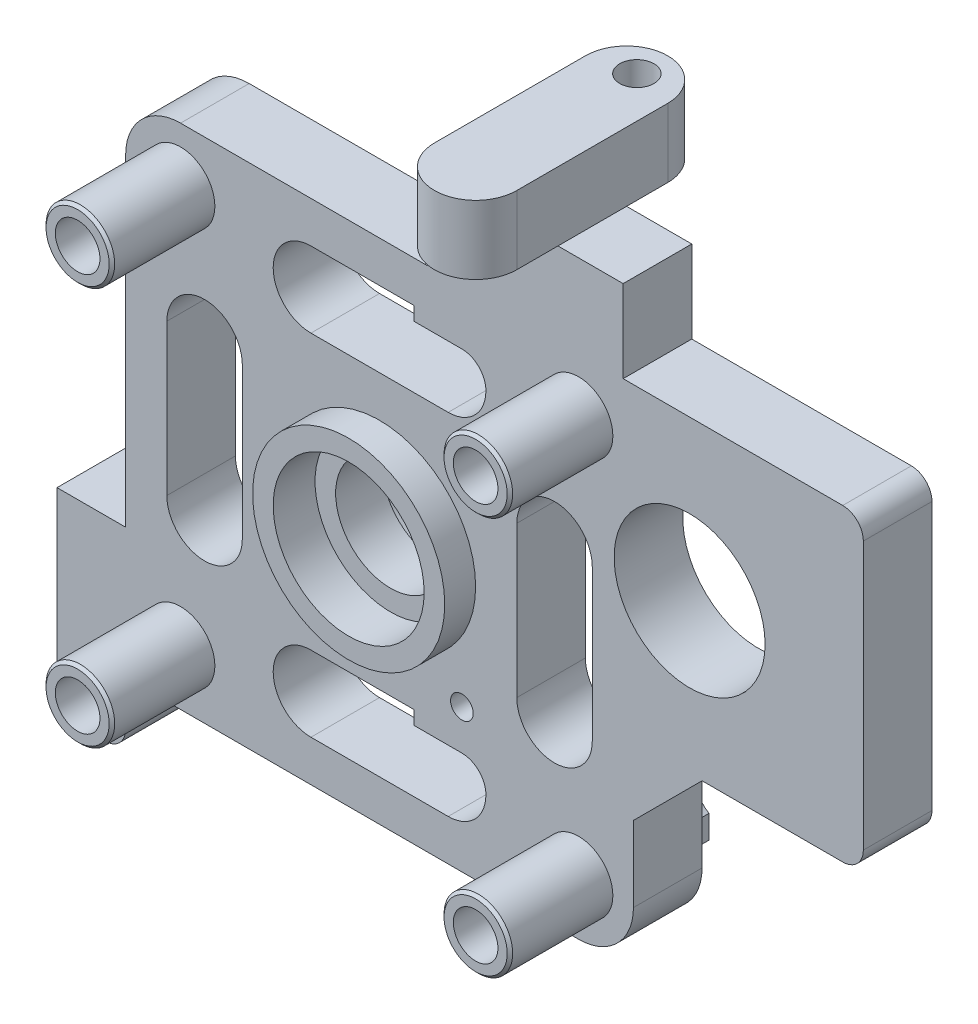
ISO-10303-21;
HEADER;
FILE_DESCRIPTION(('STEP AP214'),'2;1');
FILE_NAME('part.step','',(''),(''),'','','');
FILE_SCHEMA(('AUTOMOTIVE_DESIGN { 1 0 10303 214 1 1 1 1 }'));
ENDSEC;
DATA;
#1=APPLICATION_CONTEXT('core data for automotive mechanical design processes');
#2=APPLICATION_PROTOCOL_DEFINITION('international standard','automotive_design',2000,#1);
#3=PRODUCT_CONTEXT('',#1,'mechanical');
#4=PRODUCT('Part','Part','',(#3));
#5=PRODUCT_RELATED_PRODUCT_CATEGORY('part','',(#4));
#6=PRODUCT_DEFINITION_FORMATION('','',#4);
#7=PRODUCT_DEFINITION_CONTEXT('part definition',#1,'design');
#8=PRODUCT_DEFINITION('design','',#6,#7);
#9=PRODUCT_DEFINITION_SHAPE('','',#8);
#10=(LENGTH_UNIT() NAMED_UNIT(*) SI_UNIT(.MILLI.,.METRE.));
#11=(NAMED_UNIT(*) PLANE_ANGLE_UNIT() SI_UNIT($,.RADIAN.));
#12=(NAMED_UNIT(*) SI_UNIT($,.STERADIAN.) SOLID_ANGLE_UNIT());
#13=UNCERTAINTY_MEASURE_WITH_UNIT(LENGTH_MEASURE(1.E-05),#10,'distance_accuracy_value','');
#14=(GEOMETRIC_REPRESENTATION_CONTEXT(3) GLOBAL_UNCERTAINTY_ASSIGNED_CONTEXT((#13)) GLOBAL_UNIT_ASSIGNED_CONTEXT((#10,
#11,#12)) REPRESENTATION_CONTEXT('',''));
#15=CARTESIAN_POINT('',(0.,0.,0.));
#16=DIRECTION('',(0.,0.,1.));
#17=DIRECTION('',(1.,0.,0.));
#18=AXIS2_PLACEMENT_3D('',#15,#16,#17);
#19=CARTESIAN_POINT('',(0.,0.,3.4));
#20=DIRECTION('',(0.,0.,1.));
#21=DIRECTION('',(1.,0.,0.));
#22=AXIS2_PLACEMENT_3D('',#19,#20,#21);
#23=PLANE('',#22);
#24=CARTESIAN_POINT('',(0.,0.,3.4));
#25=DIRECTION('',(0.,0.,1.));
#26=DIRECTION('',(1.,0.,0.));
#27=AXIS2_PLACEMENT_3D('',#24,#25,#26);
#28=CIRCLE('',#27,8.);
#29=CARTESIAN_POINT('',(8.,0.,3.4));
#30=VERTEX_POINT('',#29);
#31=EDGE_CURVE('E21',#30,#30,#28,.F.);
#32=ORIENTED_EDGE('',*,*,#31,.T.);
#33=EDGE_LOOP('',(#32));
#34=FACE_BOUND('',#33,.T.);
#35=CARTESIAN_POINT('',(0.,0.,3.4));
#36=DIRECTION('',(0.,0.,1.));
#37=DIRECTION('',(1.,0.,0.));
#38=AXIS2_PLACEMENT_3D('',#35,#36,#37);
#39=CIRCLE('',#38,11.);
#40=CARTESIAN_POINT('',(11.,0.,3.4));
#41=VERTEX_POINT('',#40);
#42=EDGE_CURVE('E601',#41,#41,#39,.T.);
#43=ORIENTED_EDGE('',*,*,#42,.T.);
#44=EDGE_LOOP('',(#43));
#45=FACE_BOUND('',#44,.T.);
#46=ADVANCED_FACE('F17',(#34,#45),#23,.T.);
#47=CARTESIAN_POINT('',(0.,0.,-3.4));
#48=DIRECTION('',(0.,0.,1.));
#49=DIRECTION('',(1.,0.,0.));
#50=AXIS2_PLACEMENT_3D('',#47,#48,#49);
#51=CYLINDRICAL_SURFACE('',#50,8.);
#52=ORIENTED_EDGE('',*,*,#31,.F.);
#53=EDGE_LOOP('',(#52));
#54=FACE_BOUND('',#53,.T.);
#55=CARTESIAN_POINT('',(0.,0.,-3.4));
#56=DIRECTION('',(0.,0.,1.));
#57=DIRECTION('',(1.,0.,0.));
#58=AXIS2_PLACEMENT_3D('',#55,#56,#57);
#59=CIRCLE('',#58,8.);
#60=CARTESIAN_POINT('',(8.,0.,-3.4));
#61=VERTEX_POINT('',#60);
#62=EDGE_CURVE('E599',#61,#61,#59,.F.);
#63=ORIENTED_EDGE('',*,*,#62,.T.);
#64=EDGE_LOOP('',(#63));
#65=FACE_BOUND('',#64,.T.);
#66=ADVANCED_FACE('F609',(#54,#65),#51,.F.);
#67=CARTESIAN_POINT('',(0.,0.,-5.));
#68=DIRECTION('',(0.,0.,1.));
#69=DIRECTION('',(1.,0.,0.));
#70=AXIS2_PLACEMENT_3D('',#67,#68,#69);
#71=CYLINDRICAL_SURFACE('',#70,11.);
#72=CARTESIAN_POINT('',(0.,0.,9.5));
#73=DIRECTION('',(0.,0.,1.));
#74=DIRECTION('',(1.,0.,0.));
#75=AXIS2_PLACEMENT_3D('',#72,#73,#74);
#76=CIRCLE('',#75,11.);
#77=CARTESIAN_POINT('',(11.,0.,9.5));
#78=VERTEX_POINT('',#77);
#79=EDGE_CURVE('E308',#78,#78,#76,.F.);
#80=ORIENTED_EDGE('',*,*,#79,.F.);
#81=EDGE_LOOP('',(#80));
#82=FACE_BOUND('',#81,.T.);
#83=ORIENTED_EDGE('',*,*,#42,.F.);
#84=EDGE_LOOP('',(#83));
#85=FACE_BOUND('',#84,.T.);
#86=ADVANCED_FACE('F612',(#82,#85),#71,.F.);
#87=CARTESIAN_POINT('',(0.,0.,-3.4));
#88=DIRECTION('',(0.,0.,1.));
#89=DIRECTION('',(1.,0.,0.));
#90=AXIS2_PLACEMENT_3D('',#87,#88,#89);
#91=PLANE('',#90);
#92=ORIENTED_EDGE('',*,*,#62,.F.);
#93=EDGE_LOOP('',(#92));
#94=FACE_BOUND('',#93,.T.);
#95=CARTESIAN_POINT('',(0.,0.,-3.4));
#96=DIRECTION('',(0.,0.,1.));
#97=DIRECTION('',(1.,0.,0.));
#98=AXIS2_PLACEMENT_3D('',#95,#96,#97);
#99=CIRCLE('',#98,11.);
#100=CARTESIAN_POINT('',(11.,0.,-3.4));
#101=VERTEX_POINT('',#100);
#102=EDGE_CURVE('E307',#101,#101,#99,.F.);
#103=ORIENTED_EDGE('',*,*,#102,.T.);
#104=EDGE_LOOP('',(#103));
#105=FACE_BOUND('',#104,.T.);
#106=ADVANCED_FACE('F616',(#94,#105),#91,.F.);
#107=CARTESIAN_POINT('',(0.,0.,9.5));
#108=DIRECTION('',(0.,0.,1.));
#109=DIRECTION('',(1.,0.,0.));
#110=AXIS2_PLACEMENT_3D('',#107,#108,#109);
#111=PLANE('',#110);
#112=ORIENTED_EDGE('',*,*,#79,.T.);
#113=EDGE_LOOP('',(#112));
#114=FACE_BOUND('',#113,.T.);
#115=CARTESIAN_POINT('',(0.,0.,9.5));
#116=DIRECTION('',(0.,0.,1.));
#117=DIRECTION('',(1.,0.,0.));
#118=AXIS2_PLACEMENT_3D('',#115,#116,#117);
#119=CIRCLE('',#118,14.);
#120=CARTESIAN_POINT('',(14.,0.,9.5));
#121=VERTEX_POINT('',#120);
#122=EDGE_CURVE('E588',#121,#121,#119,.F.);
#123=ORIENTED_EDGE('',*,*,#122,.F.);
#124=EDGE_LOOP('',(#123));
#125=FACE_BOUND('',#124,.T.);
#126=ADVANCED_FACE('F619',(#114,#125),#111,.T.);
#127=CARTESIAN_POINT('',(20.,49.,11.));
#128=DIRECTION('',(0.,1.,0.));
#129=DIRECTION('',(0.,0.,1.));
#130=AXIS2_PLACEMENT_3D('',#127,#128,#129);
#131=CYLINDRICAL_SURFACE('',#130,6.);
#132=DIRECTION('',(0.,1.,0.));
#133=VECTOR('',#132,1.);
#134=CARTESIAN_POINT('',(14.,49.,11.));
#135=LINE('',#134,#133);
#136=CARTESIAN_POINT('',(14.,49.,11.));
#137=VERTEX_POINT('',#136);
#138=CARTESIAN_POINT('',(14.,59.,11.));
#139=VERTEX_POINT('',#138);
#140=EDGE_CURVE('E286',#137,#139,#135,.T.);
#141=ORIENTED_EDGE('',*,*,#140,.F.);
#142=CARTESIAN_POINT('',(20.,49.,11.));
#143=DIRECTION('',(0.,1.,0.));
#144=DIRECTION('',(0.,0.,1.));
#145=AXIS2_PLACEMENT_3D('',#142,#143,#144);
#146=CIRCLE('',#145,6.);
#147=CARTESIAN_POINT('',(26.,49.,11.));
#148=VERTEX_POINT('',#147);
#149=EDGE_CURVE('E593',#137,#148,#146,.T.);
#150=ORIENTED_EDGE('',*,*,#149,.T.);
#151=DIRECTION('',(0.,1.,0.));
#152=VECTOR('',#151,1.);
#153=CARTESIAN_POINT('',(26.,49.,11.));
#154=LINE('',#153,#152);
#155=CARTESIAN_POINT('',(26.,59.,11.));
#156=VERTEX_POINT('',#155);
#157=EDGE_CURVE('E303',#156,#148,#154,.F.);
#158=ORIENTED_EDGE('',*,*,#157,.F.);
#159=CARTESIAN_POINT('',(20.,59.,11.));
#160=DIRECTION('',(0.,1.,0.));
#161=DIRECTION('',(0.,0.,1.));
#162=AXIS2_PLACEMENT_3D('',#159,#160,#161);
#163=CIRCLE('',#162,6.);
#164=EDGE_CURVE('E301',#139,#156,#163,.T.);
#165=ORIENTED_EDGE('',*,*,#164,.F.);
#166=EDGE_LOOP('',(#141,#150,#158,#165));
#167=FACE_BOUND('',#166,.T.);
#168=ADVANCED_FACE('F302',(#167),#131,.T.);
#169=CARTESIAN_POINT('',(0.,59.,-5.));
#170=DIRECTION('',(0.,1.,0.));
#171=DIRECTION('',(0.,0.,1.));
#172=AXIS2_PLACEMENT_3D('',#169,#170,#171);
#173=PLANE('',#172);
#174=CARTESIAN_POINT('',(20.,59.,-12.5));
#175=DIRECTION('',(0.,1.,0.));
#176=DIRECTION('',(0.,0.,1.));
#177=AXIS2_PLACEMENT_3D('',#174,#175,#176);
#178=CIRCLE('',#177,2.5);
#179=CARTESIAN_POINT('',(20.,59.,-10.));
#180=VERTEX_POINT('',#179);
#181=EDGE_CURVE('E566',#180,#180,#178,.F.);
#182=ORIENTED_EDGE('',*,*,#181,.T.);
#183=EDGE_LOOP('',(#182));
#184=FACE_BOUND('',#183,.T.);
#185=DIRECTION('',(0.,0.,-1.));
#186=VECTOR('',#185,1.);
#187=CARTESIAN_POINT('',(26.,59.,11.));
#188=LINE('',#187,#186);
#189=CARTESIAN_POINT('',(26.,59.,-11.));
#190=VERTEX_POINT('',#189);
#191=EDGE_CURVE('E321',#190,#156,#188,.F.);
#192=ORIENTED_EDGE('',*,*,#191,.F.);
#193=CARTESIAN_POINT('',(20.,59.,-11.));
#194=DIRECTION('',(0.,1.,0.));
#195=DIRECTION('',(0.,0.,1.));
#196=AXIS2_PLACEMENT_3D('',#193,#194,#195);
#197=CIRCLE('',#196,6.);
#198=CARTESIAN_POINT('',(14.,59.,-11.));
#199=VERTEX_POINT('',#198);
#200=EDGE_CURVE('E311',#199,#190,#197,.F.);
#201=ORIENTED_EDGE('',*,*,#200,.F.);
#202=DIRECTION('',(0.,0.,1.));
#203=VECTOR('',#202,1.);
#204=CARTESIAN_POINT('',(14.,59.,-11.));
#205=LINE('',#204,#203);
#206=EDGE_CURVE('E291',#139,#199,#205,.F.);
#207=ORIENTED_EDGE('',*,*,#206,.F.);
#208=ORIENTED_EDGE('',*,*,#164,.T.);
#209=EDGE_LOOP('',(#192,#201,#207,#208));
#210=FACE_BOUND('',#209,.T.);
#211=ADVANCED_FACE('F310',(#184,#210),#173,.T.);
#212=CARTESIAN_POINT('',(29.,-29.,19.5998435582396));
#213=DIRECTION('',(0.,0.,-1.));
#214=DIRECTION('',(-1.,0.,0.));
#215=AXIS2_PLACEMENT_3D('',#212,#213,#214);
#216=CONICAL_SURFACE('',#215,4.9998873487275,0.785371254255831);
#217=CARTESIAN_POINT('',(29.,-29.,19.5997309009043));
#218=DIRECTION('',(0.,0.,-1.));
#219=DIRECTION('',(-1.,0.,0.));
#220=AXIS2_PLACEMENT_3D('',#217,#218,#219);
#221=CIRCLE('',#220,5.);
#222=CARTESIAN_POINT('',(24.,-29.,19.5997309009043));
#223=VERTEX_POINT('',#222);
#224=EDGE_CURVE('E323',#223,#223,#221,.T.);
#225=ORIENTED_EDGE('',*,*,#224,.F.);
#226=EDGE_LOOP('',(#225));
#227=FACE_BOUND('',#226,.T.);
#228=CARTESIAN_POINT('',(29.,-29.,20.));
#229=DIRECTION('',(0.,0.,1.));
#230=DIRECTION('',(1.,0.,0.));
#231=AXIS2_PLACEMENT_3D('',#228,#229,#230);
#232=CIRCLE('',#231,4.59975244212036);
#233=CARTESIAN_POINT('',(33.5997524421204,-29.,20.));
#234=VERTEX_POINT('',#233);
#235=EDGE_CURVE('E315',#234,#234,#232,.T.);
#236=ORIENTED_EDGE('',*,*,#235,.F.);
#237=EDGE_LOOP('',(#236));
#238=FACE_BOUND('',#237,.T.);
#239=ADVANCED_FACE('F1908',(#227,#238),#216,.T.);
#240=CARTESIAN_POINT('',(-29.,-29.,19.5998435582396));
#241=DIRECTION('',(0.,0.,-1.));
#242=DIRECTION('',(-1.,0.,0.));
#243=AXIS2_PLACEMENT_3D('',#240,#241,#242);
#244=CONICAL_SURFACE('',#243,4.9998873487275,0.785371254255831);
#245=CARTESIAN_POINT('',(-29.,-29.,19.5997309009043));
#246=DIRECTION('',(0.,0.,-1.));
#247=DIRECTION('',(-1.,0.,0.));
#248=AXIS2_PLACEMENT_3D('',#245,#246,#247);
#249=CIRCLE('',#248,5.);
#250=CARTESIAN_POINT('',(-34.,-29.,19.5997309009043));
#251=VERTEX_POINT('',#250);
#252=EDGE_CURVE('E573',#251,#251,#249,.T.);
#253=ORIENTED_EDGE('',*,*,#252,.F.);
#254=EDGE_LOOP('',(#253));
#255=FACE_BOUND('',#254,.T.);
#256=CARTESIAN_POINT('',(-29.,-29.,20.));
#257=DIRECTION('',(0.,0.,1.));
#258=DIRECTION('',(1.,0.,0.));
#259=AXIS2_PLACEMENT_3D('',#256,#257,#258);
#260=CIRCLE('',#259,4.59975244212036);
#261=CARTESIAN_POINT('',(-24.4002475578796,-29.,20.));
#262=VERTEX_POINT('',#261);
#263=EDGE_CURVE('E561',#262,#262,#260,.T.);
#264=ORIENTED_EDGE('',*,*,#263,.F.);
#265=EDGE_LOOP('',(#264));
#266=FACE_BOUND('',#265,.T.);
#267=ADVANCED_FACE('F1900',(#255,#266),#244,.T.);
#268=CARTESIAN_POINT('',(-29.,29.,19.5998435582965));
#269=DIRECTION('',(0.,0.,-1.));
#270=DIRECTION('',(-1.,0.,0.));
#271=AXIS2_PLACEMENT_3D('',#268,#269,#270);
#272=CONICAL_SURFACE('',#271,4.99988734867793,0.785371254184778);
#273=CARTESIAN_POINT('',(-29.,29.,19.5997309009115));
#274=DIRECTION('',(0.,0.,-1.));
#275=DIRECTION('',(-1.,0.,0.));
#276=AXIS2_PLACEMENT_3D('',#273,#274,#275);
#277=CIRCLE('',#276,5.);
#278=CARTESIAN_POINT('',(-34.,29.,19.5997309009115));
#279=VERTEX_POINT('',#278);
#280=EDGE_CURVE('E578',#279,#279,#277,.T.);
#281=ORIENTED_EDGE('',*,*,#280,.F.);
#282=EDGE_LOOP('',(#281));
#283=FACE_BOUND('',#282,.T.);
#284=CARTESIAN_POINT('',(-29.,29.,20.));
#285=DIRECTION('',(0.,0.,1.));
#286=DIRECTION('',(1.,0.,0.));
#287=AXIS2_PLACEMENT_3D('',#284,#285,#286);
#288=CIRCLE('',#287,4.59975244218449);
#289=CARTESIAN_POINT('',(-24.4002475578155,29.,20.));
#290=VERTEX_POINT('',#289);
#291=EDGE_CURVE('E558',#290,#290,#288,.T.);
#292=ORIENTED_EDGE('',*,*,#291,.F.);
#293=EDGE_LOOP('',(#292));
#294=FACE_BOUND('',#293,.T.);
#295=ADVANCED_FACE('F637',(#283,#294),#272,.T.);
#296=CARTESIAN_POINT('',(29.,29.,19.5998435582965));
#297=DIRECTION('',(0.,0.,-1.));
#298=DIRECTION('',(-1.,0.,0.));
#299=AXIS2_PLACEMENT_3D('',#296,#297,#298);
#300=CONICAL_SURFACE('',#299,4.99988734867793,0.785371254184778);
#301=CARTESIAN_POINT('',(29.,29.,19.5997309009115));
#302=DIRECTION('',(0.,0.,-1.));
#303=DIRECTION('',(-1.,0.,0.));
#304=AXIS2_PLACEMENT_3D('',#301,#302,#303);
#305=CIRCLE('',#304,5.);
#306=CARTESIAN_POINT('',(24.,29.,19.5997309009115));
#307=VERTEX_POINT('',#306);
#308=EDGE_CURVE('E583',#307,#307,#305,.T.);
#309=ORIENTED_EDGE('',*,*,#308,.F.);
#310=EDGE_LOOP('',(#309));
#311=FACE_BOUND('',#310,.T.);
#312=CARTESIAN_POINT('',(29.,29.,20.));
#313=DIRECTION('',(0.,0.,1.));
#314=DIRECTION('',(1.,0.,0.));
#315=AXIS2_PLACEMENT_3D('',#312,#313,#314);
#316=CIRCLE('',#315,4.59975244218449);
#317=CARTESIAN_POINT('',(33.5997524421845,29.,20.));
#318=VERTEX_POINT('',#317);
#319=EDGE_CURVE('E555',#318,#318,#316,.T.);
#320=ORIENTED_EDGE('',*,*,#319,.F.);
#321=EDGE_LOOP('',(#320));
#322=FACE_BOUND('',#321,.T.);
#323=ADVANCED_FACE('F626',(#311,#322),#300,.T.);
#324=CARTESIAN_POINT('',(0.,0.,-5.));
#325=DIRECTION('',(0.,0.,1.));
#326=DIRECTION('',(1.,0.,0.));
#327=AXIS2_PLACEMENT_3D('',#324,#325,#326);
#328=CYLINDRICAL_SURFACE('',#327,11.);
#329=CARTESIAN_POINT('',(0.,0.,-9.5));
#330=DIRECTION('',(0.,0.,1.));
#331=DIRECTION('',(1.,0.,0.));
#332=AXIS2_PLACEMENT_3D('',#329,#330,#331);
#333=CIRCLE('',#332,11.);
#334=CARTESIAN_POINT('',(11.,0.,-9.5));
#335=VERTEX_POINT('',#334);
#336=EDGE_CURVE('E552',#335,#335,#333,.F.);
#337=ORIENTED_EDGE('',*,*,#336,.T.);
#338=EDGE_LOOP('',(#337));
#339=FACE_BOUND('',#338,.T.);
#340=ORIENTED_EDGE('',*,*,#102,.F.);
#341=EDGE_LOOP('',(#340));
#342=FACE_BOUND('',#341,.T.);
#343=ADVANCED_FACE('F623',(#339,#342),#328,.F.);
#344=CARTESIAN_POINT('',(0.,49.,-5.));
#345=DIRECTION('',(0.,1.,0.));
#346=DIRECTION('',(0.,0.,1.));
#347=AXIS2_PLACEMENT_3D('',#344,#345,#346);
#348=PLANE('',#347);
#349=ORIENTED_EDGE('',*,*,#149,.F.);
#350=DIRECTION('',(0.,0.,1.));
#351=VECTOR('',#350,1.);
#352=CARTESIAN_POINT('',(14.,49.,-11.));
#353=LINE('',#352,#351);
#354=CARTESIAN_POINT('',(14.,49.,5.));
#355=VERTEX_POINT('',#354);
#356=EDGE_CURVE('E295',#355,#137,#353,.T.);
#357=ORIENTED_EDGE('',*,*,#356,.F.);
#358=DIRECTION('',(1.,0.,0.));
#359=VECTOR('',#358,1.);
#360=CARTESIAN_POINT('',(0.,49.,5.));
#361=LINE('',#360,#359);
#362=CARTESIAN_POINT('',(26.,49.,5.));
#363=VERTEX_POINT('',#362);
#364=EDGE_CURVE('E551',#363,#355,#361,.F.);
#365=ORIENTED_EDGE('',*,*,#364,.F.);
#366=DIRECTION('',(0.,0.,-1.));
#367=VECTOR('',#366,1.);
#368=CARTESIAN_POINT('',(26.,49.,11.));
#369=LINE('',#368,#367);
#370=EDGE_CURVE('E324',#148,#363,#369,.T.);
#371=ORIENTED_EDGE('',*,*,#370,.F.);
#372=EDGE_LOOP('',(#349,#357,#365,#371));
#373=FACE_BOUND('',#372,.T.);
#374=ADVANCED_FACE('F625',(#373),#348,.F.);
#375=CARTESIAN_POINT('',(0.,0.,-9.5));
#376=DIRECTION('',(0.,0.,1.));
#377=DIRECTION('',(1.,0.,0.));
#378=AXIS2_PLACEMENT_3D('',#375,#376,#377);
#379=CYLINDRICAL_SURFACE('',#378,14.);
#380=ORIENTED_EDGE('',*,*,#122,.T.);
#381=EDGE_LOOP('',(#380));
#382=FACE_BOUND('',#381,.T.);
#383=CARTESIAN_POINT('',(0.,0.,5.));
#384=DIRECTION('',(0.,0.,1.));
#385=DIRECTION('',(1.,0.,0.));
#386=AXIS2_PLACEMENT_3D('',#383,#384,#385);
#387=CIRCLE('',#386,14.);
#388=CARTESIAN_POINT('',(14.,0.,5.));
#389=VERTEX_POINT('',#388);
#390=EDGE_CURVE('E548',#389,#389,#387,.F.);
#391=ORIENTED_EDGE('',*,*,#390,.F.);
#392=EDGE_LOOP('',(#391));
#393=FACE_BOUND('',#392,.T.);
#394=ADVANCED_FACE('F634',(#382,#393),#379,.T.);
#395=CARTESIAN_POINT('',(29.,29.,-5.));
#396=DIRECTION('',(0.,0.,1.));
#397=DIRECTION('',(1.,0.,0.));
#398=AXIS2_PLACEMENT_3D('',#395,#396,#397);
#399=CYLINDRICAL_SURFACE('',#398,5.);
#400=CARTESIAN_POINT('',(29.,29.,5.));
#401=DIRECTION('',(0.,0.,1.));
#402=DIRECTION('',(1.,0.,0.));
#403=AXIS2_PLACEMENT_3D('',#400,#401,#402);
#404=CIRCLE('',#403,5.);
#405=CARTESIAN_POINT('',(34.,29.,5.));
#406=VERTEX_POINT('',#405);
#407=EDGE_CURVE('E545',#406,#406,#404,.F.);
#408=ORIENTED_EDGE('',*,*,#407,.F.);
#409=EDGE_LOOP('',(#408));
#410=FACE_BOUND('',#409,.T.);
#411=ORIENTED_EDGE('',*,*,#308,.T.);
#412=EDGE_LOOP('',(#411));
#413=FACE_BOUND('',#412,.T.);
#414=ADVANCED_FACE('F1868',(#410,#413),#399,.T.);
#415=CARTESIAN_POINT('',(-29.,29.,-5.));
#416=DIRECTION('',(0.,0.,1.));
#417=DIRECTION('',(1.,0.,0.));
#418=AXIS2_PLACEMENT_3D('',#415,#416,#417);
#419=CYLINDRICAL_SURFACE('',#418,5.);
#420=CARTESIAN_POINT('',(-29.,29.,5.));
#421=DIRECTION('',(0.,0.,1.));
#422=DIRECTION('',(1.,0.,0.));
#423=AXIS2_PLACEMENT_3D('',#420,#421,#422);
#424=CIRCLE('',#423,5.);
#425=CARTESIAN_POINT('',(-24.,29.,5.));
#426=VERTEX_POINT('',#425);
#427=EDGE_CURVE('E542',#426,#426,#424,.F.);
#428=ORIENTED_EDGE('',*,*,#427,.F.);
#429=EDGE_LOOP('',(#428));
#430=FACE_BOUND('',#429,.T.);
#431=ORIENTED_EDGE('',*,*,#280,.T.);
#432=EDGE_LOOP('',(#431));
#433=FACE_BOUND('',#432,.T.);
#434=ADVANCED_FACE('F1860',(#430,#433),#419,.T.);
#435=CARTESIAN_POINT('',(-29.,-29.,-5.));
#436=DIRECTION('',(0.,0.,1.));
#437=DIRECTION('',(1.,0.,0.));
#438=AXIS2_PLACEMENT_3D('',#435,#436,#437);
#439=CYLINDRICAL_SURFACE('',#438,5.);
#440=CARTESIAN_POINT('',(-29.,-29.,5.));
#441=DIRECTION('',(0.,0.,1.));
#442=DIRECTION('',(1.,0.,0.));
#443=AXIS2_PLACEMENT_3D('',#440,#441,#442);
#444=CIRCLE('',#443,5.);
#445=CARTESIAN_POINT('',(-24.,-29.,5.));
#446=VERTEX_POINT('',#445);
#447=EDGE_CURVE('E539',#446,#446,#444,.F.);
#448=ORIENTED_EDGE('',*,*,#447,.F.);
#449=EDGE_LOOP('',(#448));
#450=FACE_BOUND('',#449,.T.);
#451=ORIENTED_EDGE('',*,*,#252,.T.);
#452=EDGE_LOOP('',(#451));
#453=FACE_BOUND('',#452,.T.);
#454=ADVANCED_FACE('F1853',(#450,#453),#439,.T.);
#455=CARTESIAN_POINT('',(29.,-29.,-5.));
#456=DIRECTION('',(0.,0.,1.));
#457=DIRECTION('',(1.,0.,0.));
#458=AXIS2_PLACEMENT_3D('',#455,#456,#457);
#459=CYLINDRICAL_SURFACE('',#458,5.);
#460=CARTESIAN_POINT('',(29.,-29.,5.));
#461=DIRECTION('',(0.,0.,1.));
#462=DIRECTION('',(1.,0.,0.));
#463=AXIS2_PLACEMENT_3D('',#460,#461,#462);
#464=CIRCLE('',#463,5.);
#465=CARTESIAN_POINT('',(34.,-29.,5.));
#466=VERTEX_POINT('',#465);
#467=EDGE_CURVE('E536',#466,#466,#464,.F.);
#468=ORIENTED_EDGE('',*,*,#467,.F.);
#469=EDGE_LOOP('',(#468));
#470=FACE_BOUND('',#469,.T.);
#471=ORIENTED_EDGE('',*,*,#224,.T.);
#472=EDGE_LOOP('',(#471));
#473=FACE_BOUND('',#472,.T.);
#474=ADVANCED_FACE('F1366',(#470,#473),#459,.T.);
#475=CARTESIAN_POINT('',(26.,49.,11.));
#476=DIRECTION('',(1.,0.,0.));
#477=DIRECTION('',(0.,0.,-1.));
#478=AXIS2_PLACEMENT_3D('',#475,#476,#477);
#479=PLANE('',#478);
#480=ORIENTED_EDGE('',*,*,#370,.T.);
#481=DIRECTION('',(0.,0.,1.));
#482=VECTOR('',#481,1.);
#483=CARTESIAN_POINT('',(26.,49.,-5.));
#484=LINE('',#483,#482);
#485=CARTESIAN_POINT('',(26.,49.,-5.));
#486=VERTEX_POINT('',#485);
#487=EDGE_CURVE('E1006',#486,#363,#484,.T.);
#488=ORIENTED_EDGE('',*,*,#487,.F.);
#489=DIRECTION('',(0.,0.,1.));
#490=VECTOR('',#489,1.);
#491=CARTESIAN_POINT('',(26.,49.,-5.));
#492=LINE('',#491,#490);
#493=CARTESIAN_POINT('',(26.,49.,-11.));
#494=VERTEX_POINT('',#493);
#495=EDGE_CURVE('E518',#486,#494,#492,.F.);
#496=ORIENTED_EDGE('',*,*,#495,.T.);
#497=DIRECTION('',(0.,1.,0.));
#498=VECTOR('',#497,1.);
#499=CARTESIAN_POINT('',(26.,49.,-11.));
#500=LINE('',#499,#498);
#501=EDGE_CURVE('E569',#190,#494,#500,.F.);
#502=ORIENTED_EDGE('',*,*,#501,.F.);
#503=ORIENTED_EDGE('',*,*,#191,.T.);
#504=ORIENTED_EDGE('',*,*,#157,.T.);
#505=EDGE_LOOP('',(#480,#488,#496,#502,#503,#504));
#506=FACE_BOUND('',#505,.T.);
#507=ADVANCED_FACE('F1187',(#506),#479,.T.);
#508=CARTESIAN_POINT('',(20.,49.,-11.));
#509=DIRECTION('',(0.,1.,0.));
#510=DIRECTION('',(0.,0.,1.));
#511=AXIS2_PLACEMENT_3D('',#508,#509,#510);
#512=CYLINDRICAL_SURFACE('',#511,6.);
#513=ORIENTED_EDGE('',*,*,#501,.T.);
#514=CARTESIAN_POINT('',(20.,49.,-11.));
#515=DIRECTION('',(0.,1.,0.));
#516=DIRECTION('',(0.,0.,1.));
#517=AXIS2_PLACEMENT_3D('',#514,#515,#516);
#518=CIRCLE('',#517,6.);
#519=CARTESIAN_POINT('',(14.,49.,-11.));
#520=VERTEX_POINT('',#519);
#521=EDGE_CURVE('E515',#494,#520,#518,.T.);
#522=ORIENTED_EDGE('',*,*,#521,.T.);
#523=DIRECTION('',(0.,1.,0.));
#524=VECTOR('',#523,1.);
#525=CARTESIAN_POINT('',(14.,49.,-11.));
#526=LINE('',#525,#524);
#527=EDGE_CURVE('E313',#199,#520,#526,.F.);
#528=ORIENTED_EDGE('',*,*,#527,.F.);
#529=ORIENTED_EDGE('',*,*,#200,.T.);
#530=EDGE_LOOP('',(#513,#522,#528,#529));
#531=FACE_BOUND('',#530,.T.);
#532=ADVANCED_FACE('F1356',(#531),#512,.T.);
#533=CARTESIAN_POINT('',(20.,-57.05,-12.5));
#534=DIRECTION('',(0.,1.,0.));
#535=DIRECTION('',(0.,0.,1.));
#536=AXIS2_PLACEMENT_3D('',#533,#534,#535);
#537=CYLINDRICAL_SURFACE('',#536,2.5);
#538=ORIENTED_EDGE('',*,*,#181,.F.);
#539=EDGE_LOOP('',(#538));
#540=FACE_BOUND('',#539,.T.);
#541=CARTESIAN_POINT('',(20.,49.,-12.5));
#542=DIRECTION('',(0.,1.,0.));
#543=DIRECTION('',(0.,0.,1.));
#544=AXIS2_PLACEMENT_3D('',#541,#542,#543);
#545=CIRCLE('',#544,2.5);
#546=CARTESIAN_POINT('',(20.,49.,-10.));
#547=VERTEX_POINT('',#546);
#548=EDGE_CURVE('E510',#547,#547,#545,.F.);
#549=ORIENTED_EDGE('',*,*,#548,.T.);
#550=EDGE_LOOP('',(#549));
#551=FACE_BOUND('',#550,.T.);
#552=ADVANCED_FACE('F1358',(#540,#551),#537,.F.);
#553=CARTESIAN_POINT('',(14.,49.,-11.));
#554=DIRECTION('',(-1.,0.,0.));
#555=DIRECTION('',(0.,0.,1.));
#556=AXIS2_PLACEMENT_3D('',#553,#554,#555);
#557=PLANE('',#556);
#558=DIRECTION('',(0.,0.,1.));
#559=VECTOR('',#558,1.);
#560=CARTESIAN_POINT('',(14.,49.,-5.));
#561=LINE('',#560,#559);
#562=CARTESIAN_POINT('',(14.,49.,-5.));
#563=VERTEX_POINT('',#562);
#564=EDGE_CURVE('E514',#520,#563,#561,.T.);
#565=ORIENTED_EDGE('',*,*,#564,.T.);
#566=DIRECTION('',(0.,0.,1.));
#567=VECTOR('',#566,1.);
#568=CARTESIAN_POINT('',(14.,49.,-5.));
#569=LINE('',#568,#567);
#570=EDGE_CURVE('E744',#355,#563,#569,.F.);
#571=ORIENTED_EDGE('',*,*,#570,.F.);
#572=ORIENTED_EDGE('',*,*,#356,.T.);
#573=ORIENTED_EDGE('',*,*,#140,.T.);
#574=ORIENTED_EDGE('',*,*,#206,.T.);
#575=ORIENTED_EDGE('',*,*,#527,.T.);
#576=EDGE_LOOP('',(#565,#571,#572,#573,#574,#575));
#577=FACE_BOUND('',#576,.T.);
#578=ADVANCED_FACE('F289',(#577),#557,.T.);
#579=CARTESIAN_POINT('',(0.,0.,-5.));
#580=DIRECTION('',(0.,0.,-1.));
#581=DIRECTION('',(-1.,0.,0.));
#582=AXIS2_PLACEMENT_3D('',#579,#580,#581);
#583=PLANE('',#582);
#584=DIRECTION('',(0.,1.,0.));
#585=VECTOR('',#584,1.);
#586=CARTESIAN_POINT('',(14.,-37.,-5.));
#587=LINE('',#586,#585);
#588=CARTESIAN_POINT('',(14.,-29.2749172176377,-5.));
#589=VERTEX_POINT('',#588);
#590=CARTESIAN_POINT('',(14.,-22.6277186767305,-5.));
#591=VERTEX_POINT('',#590);
#592=EDGE_CURVE('E496',#589,#591,#587,.T.);
#593=ORIENTED_EDGE('',*,*,#592,.F.);
#594=CARTESIAN_POINT('',(10.,-25.5,-5.));
#595=DIRECTION('',(0.,0.,1.));
#596=DIRECTION('',(1.,0.,0.));
#597=AXIS2_PLACEMENT_3D('',#594,#595,#596);
#598=CIRCLE('',#597,5.5);
#599=CARTESIAN_POINT('',(15.5,-25.5,-5.));
#600=VERTEX_POINT('',#599);
#601=EDGE_CURVE('E489',#589,#600,#598,.T.);
#602=ORIENTED_EDGE('',*,*,#601,.T.);
#603=CARTESIAN_POINT('',(12.,-25.5,-5.));
#604=DIRECTION('',(0.,0.,1.));
#605=DIRECTION('',(1.,0.,0.));
#606=AXIS2_PLACEMENT_3D('',#603,#604,#605);
#607=CIRCLE('',#606,3.5);
#608=EDGE_CURVE('E478',#600,#591,#607,.T.);
#609=ORIENTED_EDGE('',*,*,#608,.T.);
#610=EDGE_LOOP('',(#593,#602,#609));
#611=FACE_BOUND('',#610,.T.);
#612=ADVANCED_FACE('F1331',(#611),#583,.F.);
#613=CARTESIAN_POINT('',(0.,0.,-17.));
#614=DIRECTION('',(0.,0.,-1.));
#615=DIRECTION('',(-1.,0.,0.));
#616=AXIS2_PLACEMENT_3D('',#613,#614,#615);
#617=PLANE('',#616);
#618=DIRECTION('',(0.,1.,0.));
#619=VECTOR('',#618,1.);
#620=CARTESIAN_POINT('',(26.,-22.,-17.));
#621=LINE('',#620,#619);
#622=CARTESIAN_POINT('',(26.0000000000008,-24.390227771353,-17.));
#623=VERTEX_POINT('',#622);
#624=CARTESIAN_POINT('',(26.,-22.,-17.));
#625=VERTEX_POINT('',#624);
#626=EDGE_CURVE('E535',#623,#625,#621,.T.);
#627=ORIENTED_EDGE('',*,*,#626,.F.);
#628=CARTESIAN_POINT('',(29.,-29.,-17.));
#629=DIRECTION('',(0.,0.,-1.));
#630=DIRECTION('',(-1.,0.,0.));
#631=AXIS2_PLACEMENT_3D('',#628,#629,#630);
#632=CIRCLE('',#631,5.5);
#633=CARTESIAN_POINT('',(26.,-33.6097722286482,-17.));
#634=VERTEX_POINT('',#633);
#635=EDGE_CURVE('E531',#623,#634,#632,.F.);
#636=ORIENTED_EDGE('',*,*,#635,.T.);
#637=DIRECTION('',(0.,1.,0.));
#638=VECTOR('',#637,1.);
#639=CARTESIAN_POINT('',(26.,-22.,-17.));
#640=LINE('',#639,#638);
#641=CARTESIAN_POINT('',(26.,-37.,-17.));
#642=VERTEX_POINT('',#641);
#643=EDGE_CURVE('E701',#642,#634,#640,.T.);
#644=ORIENTED_EDGE('',*,*,#643,.F.);
#645=DIRECTION('',(1.,0.,0.));
#646=VECTOR('',#645,1.);
#647=CARTESIAN_POINT('',(-37.,-37.,-17.));
#648=LINE('',#647,#646);
#649=CARTESIAN_POINT('',(14.,-37.,-17.));
#650=VERTEX_POINT('',#649);
#651=EDGE_CURVE('E809',#650,#642,#648,.T.);
#652=ORIENTED_EDGE('',*,*,#651,.F.);
#653=DIRECTION('',(0.,1.,0.));
#654=VECTOR('',#653,1.);
#655=CARTESIAN_POINT('',(14.,-37.,-17.));
#656=LINE('',#655,#654);
#657=CARTESIAN_POINT('',(14.,-22.,-17.));
#658=VERTEX_POINT('',#657);
#659=EDGE_CURVE('E690',#658,#650,#656,.F.);
#660=ORIENTED_EDGE('',*,*,#659,.F.);
#661=DIRECTION('',(1.,0.,0.));
#662=VECTOR('',#661,1.);
#663=CARTESIAN_POINT('',(14.,-22.,-17.));
#664=LINE('',#663,#662);
#665=EDGE_CURVE('E818',#625,#658,#664,.F.);
#666=ORIENTED_EDGE('',*,*,#665,.F.);
#667=EDGE_LOOP('',(#627,#636,#644,#652,#660,#666));
#668=FACE_BOUND('',#667,.T.);
#669=ADVANCED_FACE('F1374',(#668),#617,.T.);
#670=CARTESIAN_POINT('',(20.,-57.05,-12.5));
#671=DIRECTION('',(0.,1.,0.));
#672=DIRECTION('',(0.,0.,1.));
#673=AXIS2_PLACEMENT_3D('',#670,#671,#672);
#674=CYLINDRICAL_SURFACE('',#673,2.5);
#675=CARTESIAN_POINT('',(20.,-37.,-12.5));
#676=DIRECTION('',(0.,1.,0.));
#677=DIRECTION('',(0.,0.,1.));
#678=AXIS2_PLACEMENT_3D('',#675,#676,#677);
#679=CIRCLE('',#678,2.5);
#680=CARTESIAN_POINT('',(20.,-37.,-10.));
#681=VERTEX_POINT('',#680);
#682=EDGE_CURVE('E493',#681,#681,#679,.T.);
#683=ORIENTED_EDGE('',*,*,#682,.F.);
#684=EDGE_LOOP('',(#683));
#685=FACE_BOUND('',#684,.T.);
#686=CARTESIAN_POINT('',(20.,-22.,-12.5));
#687=DIRECTION('',(0.,1.,0.));
#688=DIRECTION('',(0.,0.,1.));
#689=AXIS2_PLACEMENT_3D('',#686,#687,#688);
#690=CIRCLE('',#689,2.5);
#691=CARTESIAN_POINT('',(20.,-22.,-10.));
#692=VERTEX_POINT('',#691);
#693=EDGE_CURVE('E469',#692,#692,#690,.F.);
#694=ORIENTED_EDGE('',*,*,#693,.F.);
#695=EDGE_LOOP('',(#694));
#696=FACE_BOUND('',#695,.T.);
#697=ADVANCED_FACE('F1377',(#685,#696),#674,.F.);
#698=CARTESIAN_POINT('',(0.,0.,20.));
#699=DIRECTION('',(0.,0.,1.));
#700=DIRECTION('',(1.,0.,0.));
#701=AXIS2_PLACEMENT_3D('',#698,#699,#700);
#702=PLANE('',#701);
#703=CARTESIAN_POINT('',(29.,-29.,20.));
#704=DIRECTION('',(0.,0.,1.));
#705=DIRECTION('',(1.,0.,0.));
#706=AXIS2_PLACEMENT_3D('',#703,#704,#705);
#707=CIRCLE('',#706,3.25);
#708=CARTESIAN_POINT('',(32.25,-29.,20.));
#709=VERTEX_POINT('',#708);
#710=EDGE_CURVE('E466',#709,#709,#707,.F.);
#711=ORIENTED_EDGE('',*,*,#710,.T.);
#712=EDGE_LOOP('',(#711));
#713=FACE_BOUND('',#712,.T.);
#714=ORIENTED_EDGE('',*,*,#235,.T.);
#715=EDGE_LOOP('',(#714));
#716=FACE_BOUND('',#715,.T.);
#717=ADVANCED_FACE('F1381',(#713,#716),#702,.T.);
#718=CARTESIAN_POINT('',(0.,0.,20.));
#719=DIRECTION('',(0.,0.,1.));
#720=DIRECTION('',(1.,0.,0.));
#721=AXIS2_PLACEMENT_3D('',#718,#719,#720);
#722=PLANE('',#721);
#723=CARTESIAN_POINT('',(-29.,-29.,20.));
#724=DIRECTION('',(0.,0.,1.));
#725=DIRECTION('',(1.,0.,0.));
#726=AXIS2_PLACEMENT_3D('',#723,#724,#725);
#727=CIRCLE('',#726,3.25);
#728=CARTESIAN_POINT('',(-25.75,-29.,20.));
#729=VERTEX_POINT('',#728);
#730=EDGE_CURVE('E463',#729,#729,#727,.F.);
#731=ORIENTED_EDGE('',*,*,#730,.T.);
#732=EDGE_LOOP('',(#731));
#733=FACE_BOUND('',#732,.T.);
#734=ORIENTED_EDGE('',*,*,#263,.T.);
#735=EDGE_LOOP('',(#734));
#736=FACE_BOUND('',#735,.T.);
#737=ADVANCED_FACE('F1385',(#733,#736),#722,.T.);
#738=CARTESIAN_POINT('',(0.,0.,20.));
#739=DIRECTION('',(0.,0.,1.));
#740=DIRECTION('',(1.,0.,0.));
#741=AXIS2_PLACEMENT_3D('',#738,#739,#740);
#742=PLANE('',#741);
#743=CARTESIAN_POINT('',(-29.,29.,20.));
#744=DIRECTION('',(0.,0.,1.));
#745=DIRECTION('',(1.,0.,0.));
#746=AXIS2_PLACEMENT_3D('',#743,#744,#745);
#747=CIRCLE('',#746,3.25);
#748=CARTESIAN_POINT('',(-25.75,29.,20.));
#749=VERTEX_POINT('',#748);
#750=EDGE_CURVE('E460',#749,#749,#747,.F.);
#751=ORIENTED_EDGE('',*,*,#750,.T.);
#752=EDGE_LOOP('',(#751));
#753=FACE_BOUND('',#752,.T.);
#754=ORIENTED_EDGE('',*,*,#291,.T.);
#755=EDGE_LOOP('',(#754));
#756=FACE_BOUND('',#755,.T.);
#757=ADVANCED_FACE('F1389',(#753,#756),#742,.T.);
#758=CARTESIAN_POINT('',(0.,0.,20.));
#759=DIRECTION('',(0.,0.,1.));
#760=DIRECTION('',(1.,0.,0.));
#761=AXIS2_PLACEMENT_3D('',#758,#759,#760);
#762=PLANE('',#761);
#763=CARTESIAN_POINT('',(29.,29.,20.));
#764=DIRECTION('',(0.,0.,1.));
#765=DIRECTION('',(1.,0.,0.));
#766=AXIS2_PLACEMENT_3D('',#763,#764,#765);
#767=CIRCLE('',#766,3.25);
#768=CARTESIAN_POINT('',(32.25,29.,20.));
#769=VERTEX_POINT('',#768);
#770=EDGE_CURVE('E457',#769,#769,#767,.F.);
#771=ORIENTED_EDGE('',*,*,#770,.T.);
#772=EDGE_LOOP('',(#771));
#773=FACE_BOUND('',#772,.T.);
#774=ORIENTED_EDGE('',*,*,#319,.T.);
#775=EDGE_LOOP('',(#774));
#776=FACE_BOUND('',#775,.T.);
#777=ADVANCED_FACE('F1393',(#773,#776),#762,.T.);
#778=CARTESIAN_POINT('',(0.,0.,-9.5));
#779=DIRECTION('',(0.,0.,1.));
#780=DIRECTION('',(1.,0.,0.));
#781=AXIS2_PLACEMENT_3D('',#778,#779,#780);
#782=PLANE('',#781);
#783=ORIENTED_EDGE('',*,*,#336,.F.);
#784=EDGE_LOOP('',(#783));
#785=FACE_BOUND('',#784,.T.);
#786=CARTESIAN_POINT('',(0.,0.,-9.5));
#787=DIRECTION('',(0.,0.,1.));
#788=DIRECTION('',(1.,0.,0.));
#789=AXIS2_PLACEMENT_3D('',#786,#787,#788);
#790=CIRCLE('',#789,14.);
#791=CARTESIAN_POINT('',(14.,0.,-9.5));
#792=VERTEX_POINT('',#791);
#793=EDGE_CURVE('E454',#792,#792,#790,.T.);
#794=ORIENTED_EDGE('',*,*,#793,.F.);
#795=EDGE_LOOP('',(#794));
#796=FACE_BOUND('',#795,.T.);
#797=ADVANCED_FACE('F978',(#785,#796),#782,.F.);
#798=CARTESIAN_POINT('',(0.,0.,5.));
#799=DIRECTION('',(0.,0.,1.));
#800=DIRECTION('',(1.,0.,0.));
#801=AXIS2_PLACEMENT_3D('',#798,#799,#800);
#802=PLANE('',#801);
#803=ORIENTED_EDGE('',*,*,#467,.T.);
#804=EDGE_LOOP('',(#803));
#805=FACE_BOUND('',#804,.T.);
#806=ORIENTED_EDGE('',*,*,#447,.T.);
#807=EDGE_LOOP('',(#806));
#808=FACE_BOUND('',#807,.T.);
#809=ORIENTED_EDGE('',*,*,#427,.T.);
#810=EDGE_LOOP('',(#809));
#811=FACE_BOUND('',#810,.T.);
#812=ORIENTED_EDGE('',*,*,#407,.T.);
#813=EDGE_LOOP('',(#812));
#814=FACE_BOUND('',#813,.T.);
#815=CARTESIAN_POINT('',(12.,43.81456304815,5.));
#816=DIRECTION('',(0.,0.,1.));
#817=DIRECTION('',(1.,0.,0.));
#818=AXIS2_PLACEMENT_3D('',#815,#816,#817);
#819=CIRCLE('',#818,1.65);
#820=CARTESIAN_POINT('',(13.65,43.81456304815,5.));
#821=VERTEX_POINT('',#820);
#822=EDGE_CURVE('E418',#821,#821,#819,.F.);
#823=ORIENTED_EDGE('',*,*,#822,.T.);
#824=EDGE_LOOP('',(#823));
#825=FACE_BOUND('',#824,.T.);
#826=CARTESIAN_POINT('',(12.,-16.18543695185,5.));
#827=DIRECTION('',(0.,0.,1.));
#828=DIRECTION('',(1.,0.,0.));
#829=AXIS2_PLACEMENT_3D('',#826,#827,#828);
#830=CIRCLE('',#829,1.65);
#831=CARTESIAN_POINT('',(13.65,-16.18543695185,5.));
#832=VERTEX_POINT('',#831);
#833=EDGE_CURVE('E421',#832,#832,#830,.F.);
#834=ORIENTED_EDGE('',*,*,#833,.T.);
#835=EDGE_LOOP('',(#834));
#836=FACE_BOUND('',#835,.T.);
#837=CARTESIAN_POINT('',(45.18539971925,13.81456304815,5.));
#838=DIRECTION('',(0.,0.,1.));
#839=DIRECTION('',(1.,0.,0.));
#840=AXIS2_PLACEMENT_3D('',#837,#838,#839);
#841=CIRCLE('',#840,11.);
#842=CARTESIAN_POINT('',(56.18539971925,13.81456304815,5.));
#843=VERTEX_POINT('',#842);
#844=EDGE_CURVE('E424',#843,#843,#841,.F.);
#845=ORIENTED_EDGE('',*,*,#844,.T.);
#846=EDGE_LOOP('',(#845));
#847=FACE_BOUND('',#846,.T.);
#848=CARTESIAN_POINT('',(10.,-25.5,5.));
#849=DIRECTION('',(0.,0.,1.));
#850=DIRECTION('',(1.,0.,0.));
#851=AXIS2_PLACEMENT_3D('',#848,#849,#850);
#852=CIRCLE('',#851,5.5);
#853=CARTESIAN_POINT('',(15.5,-25.5,5.));
#854=VERTEX_POINT('',#853);
#855=CARTESIAN_POINT('',(10.,-31.,5.));
#856=VERTEX_POINT('',#855);
#857=EDGE_CURVE('E486',#854,#856,#852,.F.);
#858=ORIENTED_EDGE('',*,*,#857,.T.);
#859=DIRECTION('',(1.,0.,0.));
#860=VECTOR('',#859,1.);
#861=CARTESIAN_POINT('',(-10.,-31.,5.));
#862=LINE('',#861,#860);
#863=CARTESIAN_POINT('',(-10.,-31.,5.));
#864=VERTEX_POINT('',#863);
#865=EDGE_CURVE('E878',#856,#864,#862,.F.);
#866=ORIENTED_EDGE('',*,*,#865,.T.);
#867=CARTESIAN_POINT('',(-10.,-25.5,5.));
#868=DIRECTION('',(0.,0.,1.));
#869=DIRECTION('',(1.,0.,0.));
#870=AXIS2_PLACEMENT_3D('',#867,#868,#869);
#871=CIRCLE('',#870,5.5);
#872=CARTESIAN_POINT('',(-10.,-20.,5.));
#873=VERTEX_POINT('',#872);
#874=EDGE_CURVE('E482',#864,#873,#871,.F.);
#875=ORIENTED_EDGE('',*,*,#874,.T.);
#876=DIRECTION('',(1.,0.,0.));
#877=VECTOR('',#876,1.);
#878=CARTESIAN_POINT('',(5.,-20.,5.));
#879=LINE('',#878,#877);
#880=CARTESIAN_POINT('',(5.,-20.,5.));
#881=VERTEX_POINT('',#880);
#882=EDGE_CURVE('E873',#873,#881,#879,.T.);
#883=ORIENTED_EDGE('',*,*,#882,.T.);
#884=DIRECTION('',(0.,1.,0.));
#885=VECTOR('',#884,1.);
#886=CARTESIAN_POINT('',(5.,-22.,5.));
#887=LINE('',#886,#885);
#888=CARTESIAN_POINT('',(5.,-22.,5.));
#889=VERTEX_POINT('',#888);
#890=EDGE_CURVE('E867',#881,#889,#887,.F.);
#891=ORIENTED_EDGE('',*,*,#890,.T.);
#892=DIRECTION('',(1.,0.,0.));
#893=VECTOR('',#892,1.);
#894=CARTESIAN_POINT('',(12.,-22.,5.));
#895=LINE('',#894,#893);
#896=CARTESIAN_POINT('',(12.,-22.,5.));
#897=VERTEX_POINT('',#896);
#898=EDGE_CURVE('E481',#889,#897,#895,.T.);
#899=ORIENTED_EDGE('',*,*,#898,.T.);
#900=CARTESIAN_POINT('',(12.,-25.5,5.));
#901=DIRECTION('',(0.,0.,1.));
#902=DIRECTION('',(1.,0.,0.));
#903=AXIS2_PLACEMENT_3D('',#900,#901,#902);
#904=CIRCLE('',#903,3.5);
#905=EDGE_CURVE('E473',#897,#854,#904,.F.);
#906=ORIENTED_EDGE('',*,*,#905,.T.);
#907=EDGE_LOOP('',(#858,#866,#875,#883,#891,#899,#906));
#908=FACE_BOUND('',#907,.T.);
#909=CARTESIAN_POINT('',(10.,25.5,5.));
#910=DIRECTION('',(0.,0.,1.));
#911=DIRECTION('',(1.,0.,0.));
#912=AXIS2_PLACEMENT_3D('',#909,#910,#911);
#913=CIRCLE('',#912,5.5);
#914=CARTESIAN_POINT('',(15.5,25.5,5.));
#915=VERTEX_POINT('',#914);
#916=CARTESIAN_POINT('',(10.,20.,5.));
#917=VERTEX_POINT('',#916);
#918=EDGE_CURVE('E428',#915,#917,#913,.F.);
#919=ORIENTED_EDGE('',*,*,#918,.T.);
#920=DIRECTION('',(1.,0.,0.));
#921=VECTOR('',#920,1.);
#922=CARTESIAN_POINT('',(-10.,20.,5.));
#923=LINE('',#922,#921);
#924=CARTESIAN_POINT('',(-10.,20.,5.));
#925=VERTEX_POINT('',#924);
#926=EDGE_CURVE('E824',#917,#925,#923,.F.);
#927=ORIENTED_EDGE('',*,*,#926,.T.);
#928=CARTESIAN_POINT('',(-10.,25.5,5.));
#929=DIRECTION('',(0.,0.,1.));
#930=DIRECTION('',(1.,0.,0.));
#931=AXIS2_PLACEMENT_3D('',#928,#929,#930);
#932=CIRCLE('',#931,5.5);
#933=CARTESIAN_POINT('',(-10.,31.,5.));
#934=VERTEX_POINT('',#933);
#935=EDGE_CURVE('E434',#925,#934,#932,.F.);
#936=ORIENTED_EDGE('',*,*,#935,.T.);
#937=DIRECTION('',(1.,0.,0.));
#938=VECTOR('',#937,1.);
#939=CARTESIAN_POINT('',(5.,31.,5.));
#940=LINE('',#939,#938);
#941=CARTESIAN_POINT('',(5.,31.,5.));
#942=VERTEX_POINT('',#941);
#943=EDGE_CURVE('E838',#934,#942,#940,.T.);
#944=ORIENTED_EDGE('',*,*,#943,.T.);
#945=DIRECTION('',(0.,1.,0.));
#946=VECTOR('',#945,1.);
#947=CARTESIAN_POINT('',(5.,29.,5.));
#948=LINE('',#947,#946);
#949=CARTESIAN_POINT('',(5.,29.,5.));
#950=VERTEX_POINT('',#949);
#951=EDGE_CURVE('E832',#942,#950,#948,.F.);
#952=ORIENTED_EDGE('',*,*,#951,.T.);
#953=DIRECTION('',(1.,0.,0.));
#954=VECTOR('',#953,1.);
#955=CARTESIAN_POINT('',(12.,29.,5.));
#956=LINE('',#955,#954);
#957=CARTESIAN_POINT('',(12.,29.,5.));
#958=VERTEX_POINT('',#957);
#959=EDGE_CURVE('E827',#950,#958,#956,.T.);
#960=ORIENTED_EDGE('',*,*,#959,.T.);
#961=CARTESIAN_POINT('',(12.,25.5,5.));
#962=DIRECTION('',(0.,0.,1.));
#963=DIRECTION('',(1.,0.,0.));
#964=AXIS2_PLACEMENT_3D('',#961,#962,#963);
#965=CIRCLE('',#964,3.5);
#966=EDGE_CURVE('E431',#958,#915,#965,.F.);
#967=ORIENTED_EDGE('',*,*,#966,.T.);
#968=EDGE_LOOP('',(#919,#927,#936,#944,#952,#960,#967));
#969=FACE_BOUND('',#968,.T.);
#970=CARTESIAN_POINT('',(-25.5,11.,5.));
#971=DIRECTION('',(0.,0.,1.));
#972=DIRECTION('',(1.,0.,0.));
#973=AXIS2_PLACEMENT_3D('',#970,#971,#972);
#974=CIRCLE('',#973,5.5);
#975=CARTESIAN_POINT('',(-31.,11.,5.));
#976=VERTEX_POINT('',#975);
#977=CARTESIAN_POINT('',(-20.,11.,5.));
#978=VERTEX_POINT('',#977);
#979=EDGE_CURVE('E438',#976,#978,#974,.F.);
#980=ORIENTED_EDGE('',*,*,#979,.T.);
#981=DIRECTION('',(0.,1.,0.));
#982=VECTOR('',#981,1.);
#983=CARTESIAN_POINT('',(-20.,-11.,5.));
#984=LINE('',#983,#982);
#985=CARTESIAN_POINT('',(-20.,-11.,5.));
#986=VERTEX_POINT('',#985);
#987=EDGE_CURVE('E843',#978,#986,#984,.F.);
#988=ORIENTED_EDGE('',*,*,#987,.T.);
#989=CARTESIAN_POINT('',(-25.5,-11.,5.));
#990=DIRECTION('',(0.,0.,1.));
#991=DIRECTION('',(1.,0.,0.));
#992=AXIS2_PLACEMENT_3D('',#989,#990,#991);
#993=CIRCLE('',#992,5.5);
#994=CARTESIAN_POINT('',(-31.,-11.,5.));
#995=VERTEX_POINT('',#994);
#996=EDGE_CURVE('E443',#986,#995,#993,.F.);
#997=ORIENTED_EDGE('',*,*,#996,.T.);
#998=DIRECTION('',(0.,1.,0.));
#999=VECTOR('',#998,1.);
#1000=CARTESIAN_POINT('',(-31.,11.,5.));
#1001=LINE('',#1000,#999);
#1002=EDGE_CURVE('E846',#995,#976,#1001,.T.);
#1003=ORIENTED_EDGE('',*,*,#1002,.T.);
#1004=EDGE_LOOP('',(#980,#988,#997,#1003));
#1005=FACE_BOUND('',#1004,.T.);
#1006=DIRECTION('',(0.,1.,0.));
#1007=VECTOR('',#1006,1.);
#1008=CARTESIAN_POINT('',(31.,-11.,5.));
#1009=LINE('',#1008,#1007);
#1010=CARTESIAN_POINT('',(31.,11.,5.));
#1011=VERTEX_POINT('',#1010);
#1012=CARTESIAN_POINT('',(31.,-11.,5.));
#1013=VERTEX_POINT('',#1012);
#1014=EDGE_CURVE('E848',#1011,#1013,#1009,.F.);
#1015=ORIENTED_EDGE('',*,*,#1014,.T.);
#1016=CARTESIAN_POINT('',(25.5,-11.,5.));
#1017=DIRECTION('',(0.,0.,1.));
#1018=DIRECTION('',(1.,0.,0.));
#1019=AXIS2_PLACEMENT_3D('',#1016,#1017,#1018);
#1020=CIRCLE('',#1019,5.5);
#1021=CARTESIAN_POINT('',(20.,-11.,5.));
#1022=VERTEX_POINT('',#1021);
#1023=EDGE_CURVE('E451',#1013,#1022,#1020,.F.);
#1024=ORIENTED_EDGE('',*,*,#1023,.T.);
#1025=DIRECTION('',(0.,1.,0.));
#1026=VECTOR('',#1025,1.);
#1027=CARTESIAN_POINT('',(20.,11.,5.));
#1028=LINE('',#1027,#1026);
#1029=CARTESIAN_POINT('',(20.,11.,5.));
#1030=VERTEX_POINT('',#1029);
#1031=EDGE_CURVE('E851',#1022,#1030,#1028,.T.);
#1032=ORIENTED_EDGE('',*,*,#1031,.T.);
#1033=CARTESIAN_POINT('',(25.5,11.,5.));
#1034=DIRECTION('',(0.,0.,1.));
#1035=DIRECTION('',(1.,0.,0.));
#1036=AXIS2_PLACEMENT_3D('',#1033,#1034,#1035);
#1037=CIRCLE('',#1036,5.5);
#1038=EDGE_CURVE('E447',#1030,#1011,#1037,.F.);
#1039=ORIENTED_EDGE('',*,*,#1038,.T.);
#1040=EDGE_LOOP('',(#1015,#1024,#1032,#1039));
#1041=FACE_BOUND('',#1040,.T.);
#1042=ORIENTED_EDGE('',*,*,#390,.T.);
#1043=EDGE_LOOP('',(#1042));
#1044=FACE_BOUND('',#1043,.T.);
#1045=DIRECTION('',(0.,1.,0.));
#1046=VECTOR('',#1045,1.);
#1047=CARTESIAN_POINT('',(35.5,37.,5.));
#1048=LINE('',#1047,#1046);
#1049=CARTESIAN_POINT('',(35.5,49.,5.));
#1050=VERTEX_POINT('',#1049);
#1051=CARTESIAN_POINT('',(35.5,37.,5.));
#1052=VERTEX_POINT('',#1051);
#1053=EDGE_CURVE('E770',#1050,#1052,#1048,.F.);
#1054=ORIENTED_EDGE('',*,*,#1053,.F.);
#1055=DIRECTION('',(1.,0.,0.));
#1056=VECTOR('',#1055,1.);
#1057=CARTESIAN_POINT('',(35.5,49.,5.));
#1058=LINE('',#1057,#1056);
#1059=EDGE_CURVE('E763',#363,#1050,#1058,.T.);
#1060=ORIENTED_EDGE('',*,*,#1059,.F.);
#1061=ORIENTED_EDGE('',*,*,#364,.T.);
#1062=DIRECTION('',(1.,0.,0.));
#1063=VECTOR('',#1062,1.);
#1064=CARTESIAN_POINT('',(35.5,49.,5.));
#1065=LINE('',#1064,#1063);
#1066=CARTESIAN_POINT('',(7.,49.,5.));
#1067=VERTEX_POINT('',#1066);
#1068=EDGE_CURVE('E513',#1067,#355,#1065,.T.);
#1069=ORIENTED_EDGE('',*,*,#1068,.F.);
#1070=DIRECTION('',(0.,1.,0.));
#1071=VECTOR('',#1070,1.);
#1072=CARTESIAN_POINT('',(7.,49.,5.));
#1073=LINE('',#1072,#1071);
#1074=CARTESIAN_POINT('',(7.,37.,5.));
#1075=VERTEX_POINT('',#1074);
#1076=EDGE_CURVE('E741',#1075,#1067,#1073,.T.);
#1077=ORIENTED_EDGE('',*,*,#1076,.F.);
#1078=DIRECTION('',(1.,0.,0.));
#1079=VECTOR('',#1078,1.);
#1080=CARTESIAN_POINT('',(70.5,37.,5.));
#1081=LINE('',#1080,#1079);
#1082=CARTESIAN_POINT('',(-29.,37.,5.));
#1083=VERTEX_POINT('',#1082);
#1084=EDGE_CURVE('E735',#1083,#1075,#1081,.T.);
#1085=ORIENTED_EDGE('',*,*,#1084,.F.);
#1086=CARTESIAN_POINT('',(-29.,29.,5.));
#1087=DIRECTION('',(0.,0.,-1.));
#1088=DIRECTION('',(-1.,0.,0.));
#1089=AXIS2_PLACEMENT_3D('',#1086,#1087,#1088);
#1090=CIRCLE('',#1089,8.);
#1091=CARTESIAN_POINT('',(-37.,29.,5.));
#1092=VERTEX_POINT('',#1091);
#1093=EDGE_CURVE('E506',#1092,#1083,#1090,.T.);
#1094=ORIENTED_EDGE('',*,*,#1093,.F.);
#1095=DIRECTION('',(0.,1.,0.));
#1096=VECTOR('',#1095,1.);
#1097=CARTESIAN_POINT('',(-37.,37.,5.));
#1098=LINE('',#1097,#1096);
#1099=CARTESIAN_POINT('',(-37.,-18.,5.));
#1100=VERTEX_POINT('',#1099);
#1101=EDGE_CURVE('E731',#1100,#1092,#1098,.T.);
#1102=ORIENTED_EDGE('',*,*,#1101,.F.);
#1103=DIRECTION('',(1.,0.,0.));
#1104=VECTOR('',#1103,1.);
#1105=CARTESIAN_POINT('',(-37.,-18.,5.));
#1106=LINE('',#1105,#1104);
#1107=CARTESIAN_POINT('',(-47.,-18.,5.));
#1108=VERTEX_POINT('',#1107);
#1109=EDGE_CURVE('E725',#1108,#1100,#1106,.T.);
#1110=ORIENTED_EDGE('',*,*,#1109,.F.);
#1111=DIRECTION('',(0.,1.,0.));
#1112=VECTOR('',#1111,1.);
#1113=CARTESIAN_POINT('',(-47.,-18.,5.));
#1114=LINE('',#1113,#1112);
#1115=CARTESIAN_POINT('',(-47.,-43.5,5.));
#1116=VERTEX_POINT('',#1115);
#1117=EDGE_CURVE('E719',#1116,#1108,#1114,.T.);
#1118=ORIENTED_EDGE('',*,*,#1117,.F.);
#1119=CARTESIAN_POINT('',(-44.,-43.5,5.));
#1120=DIRECTION('',(0.,0.,-1.));
#1121=DIRECTION('',(-1.,0.,0.));
#1122=AXIS2_PLACEMENT_3D('',#1119,#1120,#1121);
#1123=CIRCLE('',#1122,3.);
#1124=CARTESIAN_POINT('',(-44.,-46.5,5.));
#1125=VERTEX_POINT('',#1124);
#1126=EDGE_CURVE('E502',#1125,#1116,#1123,.T.);
#1127=ORIENTED_EDGE('',*,*,#1126,.F.);
#1128=DIRECTION('',(1.,0.,0.));
#1129=VECTOR('',#1128,1.);
#1130=CARTESIAN_POINT('',(-47.,-46.5,5.));
#1131=LINE('',#1130,#1129);
#1132=CARTESIAN_POINT('',(-40.,-46.5,5.));
#1133=VERTEX_POINT('',#1132);
#1134=EDGE_CURVE('E717',#1133,#1125,#1131,.F.);
#1135=ORIENTED_EDGE('',*,*,#1134,.F.);
#1136=CARTESIAN_POINT('',(-40.,-43.5,5.));
#1137=DIRECTION('',(0.,0.,-1.));
#1138=DIRECTION('',(-1.,0.,0.));
#1139=AXIS2_PLACEMENT_3D('',#1136,#1137,#1138);
#1140=CIRCLE('',#1139,3.);
#1141=CARTESIAN_POINT('',(-37.,-43.5,5.));
#1142=VERTEX_POINT('',#1141);
#1143=EDGE_CURVE('E498',#1142,#1133,#1140,.T.);
#1144=ORIENTED_EDGE('',*,*,#1143,.F.);
#1145=DIRECTION('',(0.,1.,0.));
#1146=VECTOR('',#1145,1.);
#1147=CARTESIAN_POINT('',(-37.,-46.5,5.));
#1148=LINE('',#1147,#1146);
#1149=CARTESIAN_POINT('',(-37.,-37.,5.));
#1150=VERTEX_POINT('',#1149);
#1151=EDGE_CURVE('E705',#1150,#1142,#1148,.F.);
#1152=ORIENTED_EDGE('',*,*,#1151,.F.);
#1153=DIRECTION('',(1.,0.,0.));
#1154=VECTOR('',#1153,1.);
#1155=CARTESIAN_POINT('',(-37.,-37.,5.));
#1156=LINE('',#1155,#1154);
#1157=CARTESIAN_POINT('',(29.,-37.,5.));
#1158=VERTEX_POINT('',#1157);
#1159=EDGE_CURVE('E710',#1158,#1150,#1156,.F.);
#1160=ORIENTED_EDGE('',*,*,#1159,.F.);
#1161=CARTESIAN_POINT('',(29.,-29.,5.));
#1162=DIRECTION('',(0.,0.,-1.));
#1163=DIRECTION('',(-1.,0.,0.));
#1164=AXIS2_PLACEMENT_3D('',#1161,#1162,#1163);
#1165=CIRCLE('',#1164,8.);
#1166=CARTESIAN_POINT('',(37.,-29.,5.));
#1167=VERTEX_POINT('',#1166);
#1168=EDGE_CURVE('E527',#1167,#1158,#1165,.T.);
#1169=ORIENTED_EDGE('',*,*,#1168,.F.);
#1170=DIRECTION('',(0.,1.,0.));
#1171=VECTOR('',#1170,1.);
#1172=CARTESIAN_POINT('',(37.,-37.,5.));
#1173=LINE('',#1172,#1171);
#1174=CARTESIAN_POINT('',(37.,-18.,5.));
#1175=VERTEX_POINT('',#1174);
#1176=EDGE_CURVE('E529',#1175,#1167,#1173,.F.);
#1177=ORIENTED_EDGE('',*,*,#1176,.F.);
#1178=DIRECTION('',(0.707106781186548,0.707106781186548,0.));
#1179=VECTOR('',#1178,1.);
#1180=CARTESIAN_POINT('',(37.,-18.,5.));
#1181=LINE('',#1180,#1179);
#1182=CARTESIAN_POINT('',(47.,-8.,5.));
#1183=VERTEX_POINT('',#1182);
#1184=EDGE_CURVE('E788',#1183,#1175,#1181,.F.);
#1185=ORIENTED_EDGE('',*,*,#1184,.F.);
#1186=DIRECTION('',(1.,0.,0.));
#1187=VECTOR('',#1186,1.);
#1188=CARTESIAN_POINT('',(47.,-8.,5.));
#1189=LINE('',#1188,#1187);
#1190=CARTESIAN_POINT('',(67.5,-8.,5.));
#1191=VERTEX_POINT('',#1190);
#1192=EDGE_CURVE('E782',#1191,#1183,#1189,.F.);
#1193=ORIENTED_EDGE('',*,*,#1192,.F.);
#1194=CARTESIAN_POINT('',(67.5,-5.,5.));
#1195=DIRECTION('',(0.,0.,-1.));
#1196=DIRECTION('',(-1.,0.,0.));
#1197=AXIS2_PLACEMENT_3D('',#1194,#1195,#1196);
#1198=CIRCLE('',#1197,3.);
#1199=CARTESIAN_POINT('',(70.5,-5.,5.));
#1200=VERTEX_POINT('',#1199);
#1201=EDGE_CURVE('E523',#1200,#1191,#1198,.T.);
#1202=ORIENTED_EDGE('',*,*,#1201,.F.);
#1203=DIRECTION('',(0.,1.,0.));
#1204=VECTOR('',#1203,1.);
#1205=CARTESIAN_POINT('',(70.5,-8.,5.));
#1206=LINE('',#1205,#1204);
#1207=CARTESIAN_POINT('',(70.5,34.,5.));
#1208=VERTEX_POINT('',#1207);
#1209=EDGE_CURVE('E780',#1208,#1200,#1206,.F.);
#1210=ORIENTED_EDGE('',*,*,#1209,.F.);
#1211=CARTESIAN_POINT('',(67.5,34.,5.));
#1212=DIRECTION('',(0.,0.,-1.));
#1213=DIRECTION('',(-1.,0.,0.));
#1214=AXIS2_PLACEMENT_3D('',#1211,#1212,#1213);
#1215=CIRCLE('',#1214,3.);
#1216=CARTESIAN_POINT('',(67.5,37.,5.));
#1217=VERTEX_POINT('',#1216);
#1218=EDGE_CURVE('E519',#1217,#1208,#1215,.T.);
#1219=ORIENTED_EDGE('',*,*,#1218,.F.);
#1220=DIRECTION('',(1.,0.,0.));
#1221=VECTOR('',#1220,1.);
#1222=CARTESIAN_POINT('',(70.5,37.,5.));
#1223=LINE('',#1222,#1221);
#1224=EDGE_CURVE('E776',#1052,#1217,#1223,.T.);
#1225=ORIENTED_EDGE('',*,*,#1224,.F.);
#1226=EDGE_LOOP('',(#1054,#1060,#1061,#1069,#1077,#1085,#1094,#1102,#1110,#1118,#1127,#1135,
#1144,#1152,#1160,#1169,#1177,#1185,#1193,#1202,#1210,#1219,#1225));
#1227=FACE_BOUND('',#1226,.T.);
#1228=ADVANCED_FACE('F974',(#805,#808,#811,#814,#825,#836,#847,#908,#969,#1005,#1041,#1044,
#1227),#802,.T.);
#1229=CARTESIAN_POINT('',(26.,-22.,-5.));
#1230=DIRECTION('',(1.,0.,0.));
#1231=DIRECTION('',(0.,0.,-1.));
#1232=AXIS2_PLACEMENT_3D('',#1229,#1230,#1231);
#1233=PLANE('',#1232);
#1234=DIRECTION('',(0.,1.,0.));
#1235=VECTOR('',#1234,1.);
#1236=CARTESIAN_POINT('',(26.,0.,-5.));
#1237=LINE('',#1236,#1235);
#1238=CARTESIAN_POINT('',(26.,-22.,-5.));
#1239=VERTEX_POINT('',#1238);
#1240=CARTESIAN_POINT('',(26.0000000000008,-24.390227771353,-5.));
#1241=VERTEX_POINT('',#1240);
#1242=EDGE_CURVE('E417',#1239,#1241,#1237,.F.);
#1243=ORIENTED_EDGE('',*,*,#1242,.T.);
#1244=DIRECTION('',(0.,0.,-1.));
#1245=VECTOR('',#1244,1.);
#1246=CARTESIAN_POINT('',(26.0000000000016,-24.3902277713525,-5.));
#1247=LINE('',#1246,#1245);
#1248=EDGE_CURVE('E534',#1241,#623,#1247,.T.);
#1249=ORIENTED_EDGE('',*,*,#1248,.T.);
#1250=ORIENTED_EDGE('',*,*,#626,.T.);
#1251=DIRECTION('',(0.,0.,1.));
#1252=VECTOR('',#1251,1.);
#1253=CARTESIAN_POINT('',(26.,-22.,-5.));
#1254=LINE('',#1253,#1252);
#1255=EDGE_CURVE('E815',#1239,#625,#1254,.F.);
#1256=ORIENTED_EDGE('',*,*,#1255,.F.);
#1257=EDGE_LOOP('',(#1243,#1249,#1250,#1256));
#1258=FACE_BOUND('',#1257,.T.);
#1259=ADVANCED_FACE('F977',(#1258),#1233,.T.);
#1260=CARTESIAN_POINT('',(29.,-29.,-5.));
#1261=DIRECTION('',(0.,0.,-1.));
#1262=DIRECTION('',(-1.,0.,0.));
#1263=AXIS2_PLACEMENT_3D('',#1260,#1261,#1262);
#1264=CYLINDRICAL_SURFACE('',#1263,5.5);
#1265=CARTESIAN_POINT('',(29.,-29.,-5.));
#1266=DIRECTION('',(0.,0.,-1.));
#1267=DIRECTION('',(-1.,0.,0.));
#1268=AXIS2_PLACEMENT_3D('',#1265,#1266,#1267);
#1269=CIRCLE('',#1268,5.5);
#1270=CARTESIAN_POINT('',(26.,-33.6097722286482,-5.));
#1271=VERTEX_POINT('',#1270);
#1272=EDGE_CURVE('E413',#1241,#1271,#1269,.F.);
#1273=ORIENTED_EDGE('',*,*,#1272,.T.);
#1274=DIRECTION('',(0.,0.,-1.));
#1275=VECTOR('',#1274,1.);
#1276=CARTESIAN_POINT('',(26.,-33.60977222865,-5.));
#1277=LINE('',#1276,#1275);
#1278=EDGE_CURVE('E530',#634,#1271,#1277,.F.);
#1279=ORIENTED_EDGE('',*,*,#1278,.F.);
#1280=ORIENTED_EDGE('',*,*,#635,.F.);
#1281=ORIENTED_EDGE('',*,*,#1248,.F.);
#1282=EDGE_LOOP('',(#1273,#1279,#1280,#1281));
#1283=FACE_BOUND('',#1282,.T.);
#1284=ADVANCED_FACE('F1236',(#1283),#1264,.F.);
#1285=CARTESIAN_POINT('',(26.,-22.,-5.));
#1286=DIRECTION('',(1.,0.,0.));
#1287=DIRECTION('',(0.,0.,-1.));
#1288=AXIS2_PLACEMENT_3D('',#1285,#1286,#1287);
#1289=PLANE('',#1288);
#1290=ORIENTED_EDGE('',*,*,#643,.T.);
#1291=ORIENTED_EDGE('',*,*,#1278,.T.);
#1292=DIRECTION('',(0.,1.,0.));
#1293=VECTOR('',#1292,1.);
#1294=CARTESIAN_POINT('',(26.,0.,-5.));
#1295=LINE('',#1294,#1293);
#1296=CARTESIAN_POINT('',(26.,-37.,-5.));
#1297=VERTEX_POINT('',#1296);
#1298=EDGE_CURVE('E416',#1271,#1297,#1295,.F.);
#1299=ORIENTED_EDGE('',*,*,#1298,.T.);
#1300=DIRECTION('',(0.,0.,-1.));
#1301=VECTOR('',#1300,1.);
#1302=CARTESIAN_POINT('',(26.,-37.,-5.));
#1303=LINE('',#1302,#1301);
#1304=EDGE_CURVE('E497',#642,#1297,#1303,.F.);
#1305=ORIENTED_EDGE('',*,*,#1304,.F.);
#1306=EDGE_LOOP('',(#1290,#1291,#1299,#1305));
#1307=FACE_BOUND('',#1306,.T.);
#1308=ADVANCED_FACE('F1232',(#1307),#1289,.T.);
#1309=CARTESIAN_POINT('',(29.,-29.,34.2684));
#1310=DIRECTION('',(0.,0.,-1.));
#1311=DIRECTION('',(-1.,0.,0.));
#1312=AXIS2_PLACEMENT_3D('',#1309,#1310,#1311);
#1313=CYLINDRICAL_SURFACE('',#1312,8.);
#1314=DIRECTION('',(0.,0.,-1.));
#1315=VECTOR('',#1314,1.);
#1316=CARTESIAN_POINT('',(29.,-37.,-5.));
#1317=LINE('',#1316,#1315);
#1318=CARTESIAN_POINT('',(29.,-37.,-5.));
#1319=VERTEX_POINT('',#1318);
#1320=EDGE_CURVE('E714',#1319,#1158,#1317,.F.);
#1321=ORIENTED_EDGE('',*,*,#1320,.F.);
#1322=CARTESIAN_POINT('',(29.,-29.,-5.));
#1323=DIRECTION('',(0.,0.,-1.));
#1324=DIRECTION('',(-1.,0.,0.));
#1325=AXIS2_PLACEMENT_3D('',#1322,#1323,#1324);
#1326=CIRCLE('',#1325,8.);
#1327=CARTESIAN_POINT('',(37.,-29.,-5.));
#1328=VERTEX_POINT('',#1327);
#1329=EDGE_CURVE('E408',#1319,#1328,#1326,.F.);
#1330=ORIENTED_EDGE('',*,*,#1329,.T.);
#1331=DIRECTION('',(0.,0.,-1.));
#1332=VECTOR('',#1331,1.);
#1333=CARTESIAN_POINT('',(37.,-29.,-5.));
#1334=LINE('',#1333,#1332);
#1335=EDGE_CURVE('E791',#1167,#1328,#1334,.T.);
#1336=ORIENTED_EDGE('',*,*,#1335,.F.);
#1337=ORIENTED_EDGE('',*,*,#1168,.T.);
#1338=EDGE_LOOP('',(#1321,#1330,#1336,#1337));
#1339=FACE_BOUND('',#1338,.T.);
#1340=ADVANCED_FACE('F1223',(#1339),#1313,.T.);
#1341=CARTESIAN_POINT('',(37.,-37.,-5.));
#1342=DIRECTION('',(1.,0.,0.));
#1343=DIRECTION('',(0.,0.,-1.));
#1344=AXIS2_PLACEMENT_3D('',#1341,#1342,#1343);
#1345=PLANE('',#1344);
#1346=ORIENTED_EDGE('',*,*,#1176,.T.);
#1347=ORIENTED_EDGE('',*,*,#1335,.T.);
#1348=DIRECTION('',(0.,1.,0.));
#1349=VECTOR('',#1348,1.);
#1350=CARTESIAN_POINT('',(37.,0.,-5.));
#1351=LINE('',#1350,#1349);
#1352=CARTESIAN_POINT('',(37.,-18.,-5.));
#1353=VERTEX_POINT('',#1352);
#1354=EDGE_CURVE('E411',#1328,#1353,#1351,.T.);
#1355=ORIENTED_EDGE('',*,*,#1354,.T.);
#1356=DIRECTION('',(0.,0.,1.));
#1357=VECTOR('',#1356,1.);
#1358=CARTESIAN_POINT('',(37.,-18.,-5.));
#1359=LINE('',#1358,#1357);
#1360=EDGE_CURVE('E785',#1175,#1353,#1359,.F.);
#1361=ORIENTED_EDGE('',*,*,#1360,.F.);
#1362=EDGE_LOOP('',(#1346,#1347,#1355,#1361));
#1363=FACE_BOUND('',#1362,.T.);
#1364=ADVANCED_FACE('F1042',(#1363),#1345,.T.);
#1365=CARTESIAN_POINT('',(37.,-18.,-5.));
#1366=DIRECTION('',(0.707106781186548,-0.707106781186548,0.));
#1367=DIRECTION('',(0.707106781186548,0.707106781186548,0.));
#1368=AXIS2_PLACEMENT_3D('',#1365,#1366,#1367);
#1369=PLANE('',#1368);
#1370=ORIENTED_EDGE('',*,*,#1360,.T.);
#1371=DIRECTION('',(0.707106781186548,0.707106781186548,0.));
#1372=VECTOR('',#1371,1.);
#1373=CARTESIAN_POINT('',(37.,-18.,-5.));
#1374=LINE('',#1373,#1372);
#1375=CARTESIAN_POINT('',(47.,-8.,-5.));
#1376=VERTEX_POINT('',#1375);
#1377=EDGE_CURVE('E1029',#1353,#1376,#1374,.T.);
#1378=ORIENTED_EDGE('',*,*,#1377,.T.);
#1379=DIRECTION('',(0.,0.,-1.));
#1380=VECTOR('',#1379,1.);
#1381=CARTESIAN_POINT('',(47.,-8.,-5.));
#1382=LINE('',#1381,#1380);
#1383=EDGE_CURVE('E526',#1183,#1376,#1382,.T.);
#1384=ORIENTED_EDGE('',*,*,#1383,.F.);
#1385=ORIENTED_EDGE('',*,*,#1184,.T.);
#1386=EDGE_LOOP('',(#1370,#1378,#1384,#1385));
#1387=FACE_BOUND('',#1386,.T.);
#1388=ADVANCED_FACE('F1035',(#1387),#1369,.T.);
#1389=CARTESIAN_POINT('',(47.,-8.,-5.));
#1390=DIRECTION('',(0.,-1.,0.));
#1391=DIRECTION('',(0.,0.,-1.));
#1392=AXIS2_PLACEMENT_3D('',#1389,#1390,#1391);
#1393=PLANE('',#1392);
#1394=DIRECTION('',(1.,0.,0.));
#1395=VECTOR('',#1394,1.);
#1396=CARTESIAN_POINT('',(0.,-8.,-5.));
#1397=LINE('',#1396,#1395);
#1398=CARTESIAN_POINT('',(67.5,-8.,-5.));
#1399=VERTEX_POINT('',#1398);
#1400=EDGE_CURVE('E407',#1376,#1399,#1397,.T.);
#1401=ORIENTED_EDGE('',*,*,#1400,.T.);
#1402=DIRECTION('',(0.,0.,-1.));
#1403=VECTOR('',#1402,1.);
#1404=CARTESIAN_POINT('',(67.5,-8.,34.2684));
#1405=LINE('',#1404,#1403);
#1406=EDGE_CURVE('E525',#1191,#1399,#1405,.T.);
#1407=ORIENTED_EDGE('',*,*,#1406,.F.);
#1408=ORIENTED_EDGE('',*,*,#1192,.T.);
#1409=ORIENTED_EDGE('',*,*,#1383,.T.);
#1410=EDGE_LOOP('',(#1401,#1407,#1408,#1409));
#1411=FACE_BOUND('',#1410,.T.);
#1412=ADVANCED_FACE('F1217',(#1411),#1393,.T.);
#1413=CARTESIAN_POINT('',(67.5,-5.,34.2684));
#1414=DIRECTION('',(0.,0.,-1.));
#1415=DIRECTION('',(-1.,0.,0.));
#1416=AXIS2_PLACEMENT_3D('',#1413,#1414,#1415);
#1417=CYLINDRICAL_SURFACE('',#1416,3.);
#1418=ORIENTED_EDGE('',*,*,#1406,.T.);
#1419=CARTESIAN_POINT('',(67.5,-5.,-5.));
#1420=DIRECTION('',(0.,0.,-1.));
#1421=DIRECTION('',(-1.,0.,0.));
#1422=AXIS2_PLACEMENT_3D('',#1419,#1420,#1421);
#1423=CIRCLE('',#1422,3.);
#1424=CARTESIAN_POINT('',(70.5,-5.,-5.));
#1425=VERTEX_POINT('',#1424);
#1426=EDGE_CURVE('E404',#1399,#1425,#1423,.F.);
#1427=ORIENTED_EDGE('',*,*,#1426,.T.);
#1428=DIRECTION('',(0.,0.,-1.));
#1429=VECTOR('',#1428,1.);
#1430=CARTESIAN_POINT('',(70.5,-5.,-5.));
#1431=LINE('',#1430,#1429);
#1432=EDGE_CURVE('E522',#1200,#1425,#1431,.T.);
#1433=ORIENTED_EDGE('',*,*,#1432,.F.);
#1434=ORIENTED_EDGE('',*,*,#1201,.T.);
#1435=EDGE_LOOP('',(#1418,#1427,#1433,#1434));
#1436=FACE_BOUND('',#1435,.T.);
#1437=ADVANCED_FACE('F1415',(#1436),#1417,.T.);
#1438=CARTESIAN_POINT('',(70.5,-8.,-5.));
#1439=DIRECTION('',(1.,0.,0.));
#1440=DIRECTION('',(0.,0.,-1.));
#1441=AXIS2_PLACEMENT_3D('',#1438,#1439,#1440);
#1442=PLANE('',#1441);
#1443=DIRECTION('',(0.,1.,0.));
#1444=VECTOR('',#1443,1.);
#1445=CARTESIAN_POINT('',(70.5,0.,-5.));
#1446=LINE('',#1445,#1444);
#1447=CARTESIAN_POINT('',(70.5,34.,-5.));
#1448=VERTEX_POINT('',#1447);
#1449=EDGE_CURVE('E403',#1425,#1448,#1446,.T.);
#1450=ORIENTED_EDGE('',*,*,#1449,.T.);
#1451=DIRECTION('',(0.,0.,-1.));
#1452=VECTOR('',#1451,1.);
#1453=CARTESIAN_POINT('',(70.5,34.,34.2684));
#1454=LINE('',#1453,#1452);
#1455=EDGE_CURVE('E521',#1208,#1448,#1454,.T.);
#1456=ORIENTED_EDGE('',*,*,#1455,.F.);
#1457=ORIENTED_EDGE('',*,*,#1209,.T.);
#1458=ORIENTED_EDGE('',*,*,#1432,.T.);
#1459=EDGE_LOOP('',(#1450,#1456,#1457,#1458));
#1460=FACE_BOUND('',#1459,.T.);
#1461=ADVANCED_FACE('F1418',(#1460),#1442,.T.);
#1462=CARTESIAN_POINT('',(67.5,34.,34.2684));
#1463=DIRECTION('',(0.,0.,-1.));
#1464=DIRECTION('',(-1.,0.,0.));
#1465=AXIS2_PLACEMENT_3D('',#1462,#1463,#1464);
#1466=CYLINDRICAL_SURFACE('',#1465,3.);
#1467=ORIENTED_EDGE('',*,*,#1455,.T.);
#1468=CARTESIAN_POINT('',(67.5,34.,-5.));
#1469=DIRECTION('',(0.,0.,-1.));
#1470=DIRECTION('',(-1.,0.,0.));
#1471=AXIS2_PLACEMENT_3D('',#1468,#1469,#1470);
#1472=CIRCLE('',#1471,3.);
#1473=CARTESIAN_POINT('',(67.5,37.,-5.));
#1474=VERTEX_POINT('',#1473);
#1475=EDGE_CURVE('E399',#1448,#1474,#1472,.F.);
#1476=ORIENTED_EDGE('',*,*,#1475,.T.);
#1477=DIRECTION('',(0.,0.,1.));
#1478=VECTOR('',#1477,1.);
#1479=CARTESIAN_POINT('',(67.5,37.,-5.));
#1480=LINE('',#1479,#1478);
#1481=EDGE_CURVE('E773',#1217,#1474,#1480,.F.);
#1482=ORIENTED_EDGE('',*,*,#1481,.F.);
#1483=ORIENTED_EDGE('',*,*,#1218,.T.);
#1484=EDGE_LOOP('',(#1467,#1476,#1482,#1483));
#1485=FACE_BOUND('',#1484,.T.);
#1486=ADVANCED_FACE('F1422',(#1485),#1466,.T.);
#1487=CARTESIAN_POINT('',(70.5,37.,-5.));
#1488=DIRECTION('',(0.,1.,0.));
#1489=DIRECTION('',(0.,0.,1.));
#1490=AXIS2_PLACEMENT_3D('',#1487,#1488,#1489);
#1491=PLANE('',#1490);
#1492=ORIENTED_EDGE('',*,*,#1224,.T.);
#1493=ORIENTED_EDGE('',*,*,#1481,.T.);
#1494=DIRECTION('',(1.,0.,0.));
#1495=VECTOR('',#1494,1.);
#1496=CARTESIAN_POINT('',(0.,37.,-5.));
#1497=LINE('',#1496,#1495);
#1498=CARTESIAN_POINT('',(35.5,37.,-5.));
#1499=VERTEX_POINT('',#1498);
#1500=EDGE_CURVE('E402',#1474,#1499,#1497,.F.);
#1501=ORIENTED_EDGE('',*,*,#1500,.T.);
#1502=DIRECTION('',(0.,0.,-1.));
#1503=VECTOR('',#1502,1.);
#1504=CARTESIAN_POINT('',(35.5,37.,-5.));
#1505=LINE('',#1504,#1503);
#1506=EDGE_CURVE('E767',#1052,#1499,#1505,.T.);
#1507=ORIENTED_EDGE('',*,*,#1506,.F.);
#1508=EDGE_LOOP('',(#1492,#1493,#1501,#1507));
#1509=FACE_BOUND('',#1508,.T.);
#1510=ADVANCED_FACE('F1426',(#1509),#1491,.T.);
#1511=CARTESIAN_POINT('',(35.5,37.,-5.));
#1512=DIRECTION('',(1.,0.,0.));
#1513=DIRECTION('',(0.,0.,-1.));
#1514=AXIS2_PLACEMENT_3D('',#1511,#1512,#1513);
#1515=PLANE('',#1514);
#1516=ORIENTED_EDGE('',*,*,#1053,.T.);
#1517=ORIENTED_EDGE('',*,*,#1506,.T.);
#1518=DIRECTION('',(0.,1.,0.));
#1519=VECTOR('',#1518,1.);
#1520=CARTESIAN_POINT('',(35.5,0.,-5.));
#1521=LINE('',#1520,#1519);
#1522=CARTESIAN_POINT('',(35.5,49.,-5.));
#1523=VERTEX_POINT('',#1522);
#1524=EDGE_CURVE('E1002',#1499,#1523,#1521,.T.);
#1525=ORIENTED_EDGE('',*,*,#1524,.T.);
#1526=DIRECTION('',(0.,0.,1.));
#1527=VECTOR('',#1526,1.);
#1528=CARTESIAN_POINT('',(35.5,49.,-5.));
#1529=LINE('',#1528,#1527);
#1530=EDGE_CURVE('E766',#1050,#1523,#1529,.F.);
#1531=ORIENTED_EDGE('',*,*,#1530,.F.);
#1532=EDGE_LOOP('',(#1516,#1517,#1525,#1531));
#1533=FACE_BOUND('',#1532,.T.);
#1534=ADVANCED_FACE('F1000',(#1533),#1515,.T.);
#1535=CARTESIAN_POINT('',(35.5,49.,-5.));
#1536=DIRECTION('',(0.,1.,0.));
#1537=DIRECTION('',(0.,0.,1.));
#1538=AXIS2_PLACEMENT_3D('',#1535,#1536,#1537);
#1539=PLANE('',#1538);
#1540=DIRECTION('',(1.,0.,0.));
#1541=VECTOR('',#1540,1.);
#1542=CARTESIAN_POINT('',(0.,49.,-5.));
#1543=LINE('',#1542,#1541);
#1544=EDGE_CURVE('E1016',#1523,#486,#1543,.F.);
#1545=ORIENTED_EDGE('',*,*,#1544,.T.);
#1546=ORIENTED_EDGE('',*,*,#487,.T.);
#1547=ORIENTED_EDGE('',*,*,#1059,.T.);
#1548=ORIENTED_EDGE('',*,*,#1530,.T.);
#1549=EDGE_LOOP('',(#1545,#1546,#1547,#1548));
#1550=FACE_BOUND('',#1549,.T.);
#1551=ADVANCED_FACE('F1172',(#1550),#1539,.T.);
#1552=CARTESIAN_POINT('',(0.,49.,-5.));
#1553=DIRECTION('',(0.,1.,0.));
#1554=DIRECTION('',(0.,0.,1.));
#1555=AXIS2_PLACEMENT_3D('',#1552,#1553,#1554);
#1556=PLANE('',#1555);
#1557=ORIENTED_EDGE('',*,*,#548,.F.);
#1558=EDGE_LOOP('',(#1557));
#1559=FACE_BOUND('',#1558,.T.);
#1560=ORIENTED_EDGE('',*,*,#521,.F.);
#1561=ORIENTED_EDGE('',*,*,#495,.F.);
#1562=DIRECTION('',(1.,0.,0.));
#1563=VECTOR('',#1562,1.);
#1564=CARTESIAN_POINT('',(0.,49.,-5.));
#1565=LINE('',#1564,#1563);
#1566=EDGE_CURVE('E1160',#486,#563,#1565,.F.);
#1567=ORIENTED_EDGE('',*,*,#1566,.T.);
#1568=ORIENTED_EDGE('',*,*,#564,.F.);
#1569=EDGE_LOOP('',(#1560,#1561,#1567,#1568));
#1570=FACE_BOUND('',#1569,.T.);
#1571=ADVANCED_FACE('F1182',(#1559,#1570),#1556,.F.);
#1572=CARTESIAN_POINT('',(35.5,49.,-5.));
#1573=DIRECTION('',(0.,1.,0.));
#1574=DIRECTION('',(0.,0.,1.));
#1575=AXIS2_PLACEMENT_3D('',#1572,#1573,#1574);
#1576=PLANE('',#1575);
#1577=ORIENTED_EDGE('',*,*,#1068,.T.);
#1578=ORIENTED_EDGE('',*,*,#570,.T.);
#1579=DIRECTION('',(1.,0.,0.));
#1580=VECTOR('',#1579,1.);
#1581=CARTESIAN_POINT('',(0.,49.,-5.));
#1582=LINE('',#1581,#1580);
#1583=CARTESIAN_POINT('',(7.,49.,-5.));
#1584=VERTEX_POINT('',#1583);
#1585=EDGE_CURVE('E1152',#563,#1584,#1582,.F.);
#1586=ORIENTED_EDGE('',*,*,#1585,.T.);
#1587=DIRECTION('',(0.,0.,1.));
#1588=VECTOR('',#1587,1.);
#1589=CARTESIAN_POINT('',(7.,49.,-5.));
#1590=LINE('',#1589,#1588);
#1591=EDGE_CURVE('E738',#1067,#1584,#1590,.F.);
#1592=ORIENTED_EDGE('',*,*,#1591,.F.);
#1593=EDGE_LOOP('',(#1577,#1578,#1586,#1592));
#1594=FACE_BOUND('',#1593,.T.);
#1595=ADVANCED_FACE('F1194',(#1594),#1576,.T.);
#1596=CARTESIAN_POINT('',(7.,49.,-5.));
#1597=DIRECTION('',(-1.,0.,0.));
#1598=DIRECTION('',(0.,0.,1.));
#1599=AXIS2_PLACEMENT_3D('',#1596,#1597,#1598);
#1600=PLANE('',#1599);
#1601=DIRECTION('',(0.,1.,0.));
#1602=VECTOR('',#1601,1.);
#1603=CARTESIAN_POINT('',(7.,0.,-5.));
#1604=LINE('',#1603,#1602);
#1605=CARTESIAN_POINT('',(7.,37.,-5.));
#1606=VERTEX_POINT('',#1605);
#1607=EDGE_CURVE('E1149',#1584,#1606,#1604,.F.);
#1608=ORIENTED_EDGE('',*,*,#1607,.T.);
#1609=DIRECTION('',(0.,0.,1.));
#1610=VECTOR('',#1609,1.);
#1611=CARTESIAN_POINT('',(7.00000000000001,37.,-5.));
#1612=LINE('',#1611,#1610);
#1613=EDGE_CURVE('E509',#1075,#1606,#1612,.F.);
#1614=ORIENTED_EDGE('',*,*,#1613,.F.);
#1615=ORIENTED_EDGE('',*,*,#1076,.T.);
#1616=ORIENTED_EDGE('',*,*,#1591,.T.);
#1617=EDGE_LOOP('',(#1608,#1614,#1615,#1616));
#1618=FACE_BOUND('',#1617,.T.);
#1619=ADVANCED_FACE('F1196',(#1618),#1600,.T.);
#1620=CARTESIAN_POINT('',(70.5,37.,-5.));
#1621=DIRECTION('',(0.,1.,0.));
#1622=DIRECTION('',(0.,0.,1.));
#1623=AXIS2_PLACEMENT_3D('',#1620,#1621,#1622);
#1624=PLANE('',#1623);
#1625=DIRECTION('',(1.,0.,0.));
#1626=VECTOR('',#1625,1.);
#1627=CARTESIAN_POINT('',(0.,37.,-5.));
#1628=LINE('',#1627,#1626);
#1629=CARTESIAN_POINT('',(-29.,37.,-5.));
#1630=VERTEX_POINT('',#1629);
#1631=EDGE_CURVE('E398',#1606,#1630,#1628,.F.);
#1632=ORIENTED_EDGE('',*,*,#1631,.T.);
#1633=DIRECTION('',(0.,0.,-1.));
#1634=VECTOR('',#1633,1.);
#1635=CARTESIAN_POINT('',(-29.,37.,34.2684));
#1636=LINE('',#1635,#1634);
#1637=EDGE_CURVE('E508',#1083,#1630,#1636,.T.);
#1638=ORIENTED_EDGE('',*,*,#1637,.F.);
#1639=ORIENTED_EDGE('',*,*,#1084,.T.);
#1640=ORIENTED_EDGE('',*,*,#1613,.T.);
#1641=EDGE_LOOP('',(#1632,#1638,#1639,#1640));
#1642=FACE_BOUND('',#1641,.T.);
#1643=ADVANCED_FACE('F1293',(#1642),#1624,.T.);
#1644=CARTESIAN_POINT('',(-29.,29.,34.2684));
#1645=DIRECTION('',(0.,0.,-1.));
#1646=DIRECTION('',(-1.,0.,0.));
#1647=AXIS2_PLACEMENT_3D('',#1644,#1645,#1646);
#1648=CYLINDRICAL_SURFACE('',#1647,8.);
#1649=ORIENTED_EDGE('',*,*,#1637,.T.);
#1650=CARTESIAN_POINT('',(-29.,29.,-5.));
#1651=DIRECTION('',(0.,0.,-1.));
#1652=DIRECTION('',(-1.,0.,0.));
#1653=AXIS2_PLACEMENT_3D('',#1650,#1651,#1652);
#1654=CIRCLE('',#1653,8.);
#1655=CARTESIAN_POINT('',(-37.,29.,-5.));
#1656=VERTEX_POINT('',#1655);
#1657=EDGE_CURVE('E394',#1630,#1656,#1654,.F.);
#1658=ORIENTED_EDGE('',*,*,#1657,.T.);
#1659=DIRECTION('',(0.,0.,1.));
#1660=VECTOR('',#1659,1.);
#1661=CARTESIAN_POINT('',(-37.,29.,-5.));
#1662=LINE('',#1661,#1660);
#1663=EDGE_CURVE('E728',#1092,#1656,#1662,.F.);
#1664=ORIENTED_EDGE('',*,*,#1663,.F.);
#1665=ORIENTED_EDGE('',*,*,#1093,.T.);
#1666=EDGE_LOOP('',(#1649,#1658,#1664,#1665));
#1667=FACE_BOUND('',#1666,.T.);
#1668=ADVANCED_FACE('F1290',(#1667),#1648,.T.);
#1669=CARTESIAN_POINT('',(-37.,37.,-5.));
#1670=DIRECTION('',(-1.,0.,0.));
#1671=DIRECTION('',(0.,0.,1.));
#1672=AXIS2_PLACEMENT_3D('',#1669,#1670,#1671);
#1673=PLANE('',#1672);
#1674=ORIENTED_EDGE('',*,*,#1101,.T.);
#1675=ORIENTED_EDGE('',*,*,#1663,.T.);
#1676=DIRECTION('',(0.,1.,0.));
#1677=VECTOR('',#1676,1.);
#1678=CARTESIAN_POINT('',(-37.,0.,-5.));
#1679=LINE('',#1678,#1677);
#1680=CARTESIAN_POINT('',(-37.,-18.,-5.));
#1681=VERTEX_POINT('',#1680);
#1682=EDGE_CURVE('E397',#1656,#1681,#1679,.F.);
#1683=ORIENTED_EDGE('',*,*,#1682,.T.);
#1684=DIRECTION('',(0.,0.,1.));
#1685=VECTOR('',#1684,1.);
#1686=CARTESIAN_POINT('',(-37.,-18.,-5.));
#1687=LINE('',#1686,#1685);
#1688=EDGE_CURVE('E722',#1100,#1681,#1687,.F.);
#1689=ORIENTED_EDGE('',*,*,#1688,.F.);
#1690=EDGE_LOOP('',(#1674,#1675,#1683,#1689));
#1691=FACE_BOUND('',#1690,.T.);
#1692=ADVANCED_FACE('F1285',(#1691),#1673,.T.);
#1693=CARTESIAN_POINT('',(-37.,-18.,-5.));
#1694=DIRECTION('',(0.,1.,0.));
#1695=DIRECTION('',(0.,0.,1.));
#1696=AXIS2_PLACEMENT_3D('',#1693,#1694,#1695);
#1697=PLANE('',#1696);
#1698=ORIENTED_EDGE('',*,*,#1109,.T.);
#1699=ORIENTED_EDGE('',*,*,#1688,.T.);
#1700=DIRECTION('',(1.,0.,0.));
#1701=VECTOR('',#1700,1.);
#1702=CARTESIAN_POINT('',(0.,-18.,-5.));
#1703=LINE('',#1702,#1701);
#1704=CARTESIAN_POINT('',(-47.,-18.,-5.));
#1705=VERTEX_POINT('',#1704);
#1706=EDGE_CURVE('E1136',#1681,#1705,#1703,.F.);
#1707=ORIENTED_EDGE('',*,*,#1706,.T.);
#1708=DIRECTION('',(0.,0.,1.));
#1709=VECTOR('',#1708,1.);
#1710=CARTESIAN_POINT('',(-47.,-18.,-5.));
#1711=LINE('',#1710,#1709);
#1712=EDGE_CURVE('E505',#1108,#1705,#1711,.F.);
#1713=ORIENTED_EDGE('',*,*,#1712,.F.);
#1714=EDGE_LOOP('',(#1698,#1699,#1707,#1713));
#1715=FACE_BOUND('',#1714,.T.);
#1716=ADVANCED_FACE('F1301',(#1715),#1697,.T.);
#1717=CARTESIAN_POINT('',(-47.,-18.,-5.));
#1718=DIRECTION('',(-1.,0.,0.));
#1719=DIRECTION('',(0.,0.,1.));
#1720=AXIS2_PLACEMENT_3D('',#1717,#1718,#1719);
#1721=PLANE('',#1720);
#1722=DIRECTION('',(0.,1.,0.));
#1723=VECTOR('',#1722,1.);
#1724=CARTESIAN_POINT('',(-47.,0.,-5.));
#1725=LINE('',#1724,#1723);
#1726=CARTESIAN_POINT('',(-47.,-43.5,-5.));
#1727=VERTEX_POINT('',#1726);
#1728=EDGE_CURVE('E393',#1705,#1727,#1725,.F.);
#1729=ORIENTED_EDGE('',*,*,#1728,.T.);
#1730=DIRECTION('',(0.,0.,-1.));
#1731=VECTOR('',#1730,1.);
#1732=CARTESIAN_POINT('',(-47.,-43.5,34.2684));
#1733=LINE('',#1732,#1731);
#1734=EDGE_CURVE('E504',#1116,#1727,#1733,.T.);
#1735=ORIENTED_EDGE('',*,*,#1734,.F.);
#1736=ORIENTED_EDGE('',*,*,#1117,.T.);
#1737=ORIENTED_EDGE('',*,*,#1712,.T.);
#1738=EDGE_LOOP('',(#1729,#1735,#1736,#1737));
#1739=FACE_BOUND('',#1738,.T.);
#1740=ADVANCED_FACE('F1303',(#1739),#1721,.T.);
#1741=CARTESIAN_POINT('',(-44.,-43.5,34.2684));
#1742=DIRECTION('',(0.,0.,-1.));
#1743=DIRECTION('',(-1.,0.,0.));
#1744=AXIS2_PLACEMENT_3D('',#1741,#1742,#1743);
#1745=CYLINDRICAL_SURFACE('',#1744,3.);
#1746=ORIENTED_EDGE('',*,*,#1734,.T.);
#1747=CARTESIAN_POINT('',(-44.,-43.5,-5.));
#1748=DIRECTION('',(0.,0.,-1.));
#1749=DIRECTION('',(-1.,0.,0.));
#1750=AXIS2_PLACEMENT_3D('',#1747,#1748,#1749);
#1751=CIRCLE('',#1750,3.);
#1752=CARTESIAN_POINT('',(-44.,-46.5,-5.));
#1753=VERTEX_POINT('',#1752);
#1754=EDGE_CURVE('E390',#1727,#1753,#1751,.F.);
#1755=ORIENTED_EDGE('',*,*,#1754,.T.);
#1756=DIRECTION('',(0.,0.,-1.));
#1757=VECTOR('',#1756,1.);
#1758=CARTESIAN_POINT('',(-44.,-46.5,-5.));
#1759=LINE('',#1758,#1757);
#1760=EDGE_CURVE('E501',#1125,#1753,#1759,.T.);
#1761=ORIENTED_EDGE('',*,*,#1760,.F.);
#1762=ORIENTED_EDGE('',*,*,#1126,.T.);
#1763=EDGE_LOOP('',(#1746,#1755,#1761,#1762));
#1764=FACE_BOUND('',#1763,.T.);
#1765=ADVANCED_FACE('F1309',(#1764),#1745,.T.);
#1766=CARTESIAN_POINT('',(-47.,-46.5,-5.));
#1767=DIRECTION('',(0.,-1.,0.));
#1768=DIRECTION('',(0.,0.,-1.));
#1769=AXIS2_PLACEMENT_3D('',#1766,#1767,#1768);
#1770=PLANE('',#1769);
#1771=ORIENTED_EDGE('',*,*,#1134,.T.);
#1772=ORIENTED_EDGE('',*,*,#1760,.T.);
#1773=DIRECTION('',(1.,0.,0.));
#1774=VECTOR('',#1773,1.);
#1775=CARTESIAN_POINT('',(0.,-46.5,-5.));
#1776=LINE('',#1775,#1774);
#1777=CARTESIAN_POINT('',(-40.,-46.5,-5.));
#1778=VERTEX_POINT('',#1777);
#1779=EDGE_CURVE('E389',#1753,#1778,#1776,.T.);
#1780=ORIENTED_EDGE('',*,*,#1779,.T.);
#1781=DIRECTION('',(0.,0.,-1.));
#1782=VECTOR('',#1781,1.);
#1783=CARTESIAN_POINT('',(-40.,-46.5,34.2684));
#1784=LINE('',#1783,#1782);
#1785=EDGE_CURVE('E500',#1133,#1778,#1784,.T.);
#1786=ORIENTED_EDGE('',*,*,#1785,.F.);
#1787=EDGE_LOOP('',(#1771,#1772,#1780,#1786));
#1788=FACE_BOUND('',#1787,.T.);
#1789=ADVANCED_FACE('F1315',(#1788),#1770,.T.);
#1790=CARTESIAN_POINT('',(-40.,-43.5,34.2684));
#1791=DIRECTION('',(0.,0.,-1.));
#1792=DIRECTION('',(-1.,0.,0.));
#1793=AXIS2_PLACEMENT_3D('',#1790,#1791,#1792);
#1794=CYLINDRICAL_SURFACE('',#1793,3.);
#1795=ORIENTED_EDGE('',*,*,#1785,.T.);
#1796=CARTESIAN_POINT('',(-40.,-43.5,-5.));
#1797=DIRECTION('',(0.,0.,-1.));
#1798=DIRECTION('',(-1.,0.,0.));
#1799=AXIS2_PLACEMENT_3D('',#1796,#1797,#1798);
#1800=CIRCLE('',#1799,3.);
#1801=CARTESIAN_POINT('',(-37.,-43.5,-5.));
#1802=VERTEX_POINT('',#1801);
#1803=EDGE_CURVE('E385',#1778,#1802,#1800,.F.);
#1804=ORIENTED_EDGE('',*,*,#1803,.T.);
#1805=DIRECTION('',(0.,0.,-1.));
#1806=VECTOR('',#1805,1.);
#1807=CARTESIAN_POINT('',(-37.,-43.5,-5.));
#1808=LINE('',#1807,#1806);
#1809=EDGE_CURVE('E707',#1142,#1802,#1808,.T.);
#1810=ORIENTED_EDGE('',*,*,#1809,.F.);
#1811=ORIENTED_EDGE('',*,*,#1143,.T.);
#1812=EDGE_LOOP('',(#1795,#1804,#1810,#1811));
#1813=FACE_BOUND('',#1812,.T.);
#1814=ADVANCED_FACE('F1317',(#1813),#1794,.T.);
#1815=CARTESIAN_POINT('',(-37.,-46.5,-5.));
#1816=DIRECTION('',(1.,0.,0.));
#1817=DIRECTION('',(0.,0.,-1.));
#1818=AXIS2_PLACEMENT_3D('',#1815,#1816,#1817);
#1819=PLANE('',#1818);
#1820=ORIENTED_EDGE('',*,*,#1151,.T.);
#1821=ORIENTED_EDGE('',*,*,#1809,.T.);
#1822=DIRECTION('',(0.,1.,0.));
#1823=VECTOR('',#1822,1.);
#1824=CARTESIAN_POINT('',(-37.,0.,-5.));
#1825=LINE('',#1824,#1823);
#1826=CARTESIAN_POINT('',(-37.,-37.,-5.));
#1827=VERTEX_POINT('',#1826);
#1828=EDGE_CURVE('E388',#1802,#1827,#1825,.T.);
#1829=ORIENTED_EDGE('',*,*,#1828,.T.);
#1830=DIRECTION('',(0.,0.,-1.));
#1831=VECTOR('',#1830,1.);
#1832=CARTESIAN_POINT('',(-37.,-37.,-5.));
#1833=LINE('',#1832,#1831);
#1834=EDGE_CURVE('E713',#1150,#1827,#1833,.T.);
#1835=ORIENTED_EDGE('',*,*,#1834,.F.);
#1836=EDGE_LOOP('',(#1820,#1821,#1829,#1835));
#1837=FACE_BOUND('',#1836,.T.);
#1838=ADVANCED_FACE('F1323',(#1837),#1819,.T.);
#1839=CARTESIAN_POINT('',(-37.,-37.,-5.));
#1840=DIRECTION('',(0.,-1.,0.));
#1841=DIRECTION('',(0.,0.,-1.));
#1842=AXIS2_PLACEMENT_3D('',#1839,#1840,#1841);
#1843=PLANE('',#1842);
#1844=ORIENTED_EDGE('',*,*,#682,.T.);
#1845=EDGE_LOOP('',(#1844));
#1846=FACE_BOUND('',#1845,.T.);
#1847=ORIENTED_EDGE('',*,*,#1304,.T.);
#1848=DIRECTION('',(1.,0.,0.));
#1849=VECTOR('',#1848,1.);
#1850=CARTESIAN_POINT('',(0.,-37.,-5.));
#1851=LINE('',#1850,#1849);
#1852=EDGE_CURVE('E412',#1297,#1319,#1851,.T.);
#1853=ORIENTED_EDGE('',*,*,#1852,.T.);
#1854=ORIENTED_EDGE('',*,*,#1320,.T.);
#1855=ORIENTED_EDGE('',*,*,#1159,.T.);
#1856=ORIENTED_EDGE('',*,*,#1834,.T.);
#1857=DIRECTION('',(1.,0.,0.));
#1858=VECTOR('',#1857,1.);
#1859=CARTESIAN_POINT('',(0.,-37.,-5.));
#1860=LINE('',#1859,#1858);
#1861=CARTESIAN_POINT('',(14.,-37.,-5.));
#1862=VERTEX_POINT('',#1861);
#1863=EDGE_CURVE('E1121',#1827,#1862,#1860,.T.);
#1864=ORIENTED_EDGE('',*,*,#1863,.T.);
#1865=DIRECTION('',(0.,0.,1.));
#1866=VECTOR('',#1865,1.);
#1867=CARTESIAN_POINT('',(14.,-37.,-5.));
#1868=LINE('',#1867,#1866);
#1869=EDGE_CURVE('E492',#650,#1862,#1868,.T.);
#1870=ORIENTED_EDGE('',*,*,#1869,.F.);
#1871=ORIENTED_EDGE('',*,*,#651,.T.);
#1872=EDGE_LOOP('',(#1847,#1853,#1854,#1855,#1856,#1864,#1870,#1871));
#1873=FACE_BOUND('',#1872,.T.);
#1874=ADVANCED_FACE('F1227',(#1846,#1873),#1843,.T.);
#1875=CARTESIAN_POINT('',(14.,-37.,-5.));
#1876=DIRECTION('',(-1.,0.,0.));
#1877=DIRECTION('',(0.,0.,1.));
#1878=AXIS2_PLACEMENT_3D('',#1875,#1876,#1877);
#1879=PLANE('',#1878);
#1880=ORIENTED_EDGE('',*,*,#1869,.T.);
#1881=DIRECTION('',(0.,1.,0.));
#1882=VECTOR('',#1881,1.);
#1883=CARTESIAN_POINT('',(14.,0.,-5.));
#1884=LINE('',#1883,#1882);
#1885=EDGE_CURVE('E384',#1862,#589,#1884,.T.);
#1886=ORIENTED_EDGE('',*,*,#1885,.T.);
#1887=ORIENTED_EDGE('',*,*,#592,.T.);
#1888=DIRECTION('',(0.,1.,0.));
#1889=VECTOR('',#1888,1.);
#1890=CARTESIAN_POINT('',(14.,-37.,-5.));
#1891=LINE('',#1890,#1889);
#1892=CARTESIAN_POINT('',(14.,-22.,-5.));
#1893=VERTEX_POINT('',#1892);
#1894=EDGE_CURVE('E682',#591,#1893,#1891,.T.);
#1895=ORIENTED_EDGE('',*,*,#1894,.T.);
#1896=DIRECTION('',(0.,0.,1.));
#1897=VECTOR('',#1896,1.);
#1898=CARTESIAN_POINT('',(14.,-22.,-5.));
#1899=LINE('',#1898,#1897);
#1900=EDGE_CURVE('E472',#658,#1893,#1899,.T.);
#1901=ORIENTED_EDGE('',*,*,#1900,.F.);
#1902=ORIENTED_EDGE('',*,*,#659,.T.);
#1903=EDGE_LOOP('',(#1880,#1886,#1887,#1895,#1901,#1902));
#1904=FACE_BOUND('',#1903,.T.);
#1905=ADVANCED_FACE('F892',(#1904),#1879,.T.);
#1906=CARTESIAN_POINT('',(10.,-25.5,-11.4));
#1907=DIRECTION('',(0.,0.,1.));
#1908=DIRECTION('',(1.,0.,0.));
#1909=AXIS2_PLACEMENT_3D('',#1906,#1907,#1908);
#1910=CYLINDRICAL_SURFACE('',#1909,5.5);
#1911=DIRECTION('',(0.,0.,-1.));
#1912=VECTOR('',#1911,1.);
#1913=CARTESIAN_POINT('',(10.,-31.,-11.4));
#1914=LINE('',#1913,#1912);
#1915=CARTESIAN_POINT('',(10.,-31.,-5.));
#1916=VERTEX_POINT('',#1915);
#1917=EDGE_CURVE('E488',#1916,#856,#1914,.F.);
#1918=ORIENTED_EDGE('',*,*,#1917,.T.);
#1919=ORIENTED_EDGE('',*,*,#857,.F.);
#1920=DIRECTION('',(0.,0.,1.));
#1921=VECTOR('',#1920,1.);
#1922=CARTESIAN_POINT('',(15.5,-25.5,-11.4));
#1923=LINE('',#1922,#1921);
#1924=EDGE_CURVE('E476',#854,#600,#1923,.F.);
#1925=ORIENTED_EDGE('',*,*,#1924,.T.);
#1926=ORIENTED_EDGE('',*,*,#601,.F.);
#1927=CARTESIAN_POINT('',(10.,-25.5,-5.));
#1928=DIRECTION('',(0.,0.,1.));
#1929=DIRECTION('',(1.,0.,0.));
#1930=AXIS2_PLACEMENT_3D('',#1927,#1928,#1929);
#1931=CIRCLE('',#1930,5.5);
#1932=EDGE_CURVE('E381',#589,#1916,#1931,.F.);
#1933=ORIENTED_EDGE('',*,*,#1932,.T.);
#1934=EDGE_LOOP('',(#1918,#1919,#1925,#1926,#1933));
#1935=FACE_BOUND('',#1934,.T.);
#1936=ADVANCED_FACE('F1327',(#1935),#1910,.F.);
#1937=CARTESIAN_POINT('',(-10.,-31.,-11.4));
#1938=DIRECTION('',(0.,-1.,0.));
#1939=DIRECTION('',(0.,0.,-1.));
#1940=AXIS2_PLACEMENT_3D('',#1937,#1938,#1939);
#1941=PLANE('',#1940);
#1942=ORIENTED_EDGE('',*,*,#865,.F.);
#1943=ORIENTED_EDGE('',*,*,#1917,.F.);
#1944=DIRECTION('',(1.,0.,0.));
#1945=VECTOR('',#1944,1.);
#1946=CARTESIAN_POINT('',(0.,-31.,-5.));
#1947=LINE('',#1946,#1945);
#1948=CARTESIAN_POINT('',(-10.,-31.,-5.));
#1949=VERTEX_POINT('',#1948);
#1950=EDGE_CURVE('E380',#1916,#1949,#1947,.F.);
#1951=ORIENTED_EDGE('',*,*,#1950,.T.);
#1952=DIRECTION('',(0.,0.,1.));
#1953=VECTOR('',#1952,1.);
#1954=CARTESIAN_POINT('',(-10.,-31.,-11.4));
#1955=LINE('',#1954,#1953);
#1956=EDGE_CURVE('E485',#1949,#864,#1955,.T.);
#1957=ORIENTED_EDGE('',*,*,#1956,.T.);
#1958=EDGE_LOOP('',(#1942,#1943,#1951,#1957));
#1959=FACE_BOUND('',#1958,.T.);
#1960=ADVANCED_FACE('F1467',(#1959),#1941,.F.);
#1961=CARTESIAN_POINT('',(-10.,-25.5,-11.4));
#1962=DIRECTION('',(0.,0.,1.));
#1963=DIRECTION('',(1.,0.,0.));
#1964=AXIS2_PLACEMENT_3D('',#1961,#1962,#1963);
#1965=CYLINDRICAL_SURFACE('',#1964,5.5);
#1966=ORIENTED_EDGE('',*,*,#874,.F.);
#1967=ORIENTED_EDGE('',*,*,#1956,.F.);
#1968=CARTESIAN_POINT('',(-10.,-25.5,-5.));
#1969=DIRECTION('',(0.,0.,1.));
#1970=DIRECTION('',(1.,0.,0.));
#1971=AXIS2_PLACEMENT_3D('',#1968,#1969,#1970);
#1972=CIRCLE('',#1971,5.5);
#1973=CARTESIAN_POINT('',(-10.,-20.,-5.));
#1974=VERTEX_POINT('',#1973);
#1975=EDGE_CURVE('E377',#1949,#1974,#1972,.F.);
#1976=ORIENTED_EDGE('',*,*,#1975,.T.);
#1977=DIRECTION('',(0.,0.,1.));
#1978=VECTOR('',#1977,1.);
#1979=CARTESIAN_POINT('',(-10.,-20.,-11.4));
#1980=LINE('',#1979,#1978);
#1981=EDGE_CURVE('E484',#1974,#873,#1980,.T.);
#1982=ORIENTED_EDGE('',*,*,#1981,.T.);
#1983=EDGE_LOOP('',(#1966,#1967,#1976,#1982));
#1984=FACE_BOUND('',#1983,.T.);
#1985=ADVANCED_FACE('F1470',(#1984),#1965,.F.);
#1986=CARTESIAN_POINT('',(5.,-20.,-11.4));
#1987=DIRECTION('',(0.,1.,0.));
#1988=DIRECTION('',(0.,0.,1.));
#1989=AXIS2_PLACEMENT_3D('',#1986,#1987,#1988);
#1990=PLANE('',#1989);
#1991=ORIENTED_EDGE('',*,*,#882,.F.);
#1992=ORIENTED_EDGE('',*,*,#1981,.F.);
#1993=DIRECTION('',(1.,0.,0.));
#1994=VECTOR('',#1993,1.);
#1995=CARTESIAN_POINT('',(0.,-20.,-5.));
#1996=LINE('',#1995,#1994);
#1997=CARTESIAN_POINT('',(5.,-20.,-5.));
#1998=VERTEX_POINT('',#1997);
#1999=EDGE_CURVE('E379',#1974,#1998,#1996,.T.);
#2000=ORIENTED_EDGE('',*,*,#1999,.T.);
#2001=DIRECTION('',(0.,0.,-1.));
#2002=VECTOR('',#2001,1.);
#2003=CARTESIAN_POINT('',(5.,-20.,-11.4));
#2004=LINE('',#2003,#2002);
#2005=EDGE_CURVE('E870',#1998,#881,#2004,.F.);
#2006=ORIENTED_EDGE('',*,*,#2005,.T.);
#2007=EDGE_LOOP('',(#1991,#1992,#2000,#2006));
#2008=FACE_BOUND('',#2007,.T.);
#2009=ADVANCED_FACE('F1257',(#2008),#1990,.F.);
#2010=CARTESIAN_POINT('',(5.,-22.,-11.4));
#2011=DIRECTION('',(1.,0.,0.));
#2012=DIRECTION('',(0.,0.,-1.));
#2013=AXIS2_PLACEMENT_3D('',#2010,#2011,#2012);
#2014=PLANE('',#2013);
#2015=ORIENTED_EDGE('',*,*,#890,.F.);
#2016=ORIENTED_EDGE('',*,*,#2005,.F.);
#2017=DIRECTION('',(0.,1.,0.));
#2018=VECTOR('',#2017,1.);
#2019=CARTESIAN_POINT('',(5.,0.,-5.));
#2020=LINE('',#2019,#2018);
#2021=CARTESIAN_POINT('',(5.,-22.,-5.));
#2022=VERTEX_POINT('',#2021);
#2023=EDGE_CURVE('E1103',#1998,#2022,#2020,.F.);
#2024=ORIENTED_EDGE('',*,*,#2023,.T.);
#2025=DIRECTION('',(0.,0.,1.));
#2026=VECTOR('',#2025,1.);
#2027=CARTESIAN_POINT('',(5.,-22.,-11.4));
#2028=LINE('',#2027,#2026);
#2029=EDGE_CURVE('E864',#2022,#889,#2028,.T.);
#2030=ORIENTED_EDGE('',*,*,#2029,.T.);
#2031=EDGE_LOOP('',(#2015,#2016,#2024,#2030));
#2032=FACE_BOUND('',#2031,.T.);
#2033=ADVANCED_FACE('F1254',(#2032),#2014,.F.);
#2034=CARTESIAN_POINT('',(12.,-22.,-11.4));
#2035=DIRECTION('',(0.,1.,0.));
#2036=DIRECTION('',(0.,0.,1.));
#2037=AXIS2_PLACEMENT_3D('',#2034,#2035,#2036);
#2038=PLANE('',#2037);
#2039=ORIENTED_EDGE('',*,*,#898,.F.);
#2040=ORIENTED_EDGE('',*,*,#2029,.F.);
#2041=DIRECTION('',(1.,0.,0.));
#2042=VECTOR('',#2041,1.);
#2043=CARTESIAN_POINT('',(0.,-22.,-5.));
#2044=LINE('',#2043,#2042);
#2045=CARTESIAN_POINT('',(12.,-22.,-5.));
#2046=VERTEX_POINT('',#2045);
#2047=EDGE_CURVE('E376',#2022,#2046,#2044,.T.);
#2048=ORIENTED_EDGE('',*,*,#2047,.T.);
#2049=DIRECTION('',(0.,0.,1.));
#2050=VECTOR('',#2049,1.);
#2051=CARTESIAN_POINT('',(12.,-22.,-11.4));
#2052=LINE('',#2051,#2050);
#2053=EDGE_CURVE('E477',#2046,#897,#2052,.T.);
#2054=ORIENTED_EDGE('',*,*,#2053,.T.);
#2055=EDGE_LOOP('',(#2039,#2040,#2048,#2054));
#2056=FACE_BOUND('',#2055,.T.);
#2057=ADVANCED_FACE('F1336',(#2056),#2038,.F.);
#2058=CARTESIAN_POINT('',(12.,-25.5,-11.4));
#2059=DIRECTION('',(0.,0.,1.));
#2060=DIRECTION('',(1.,0.,0.));
#2061=AXIS2_PLACEMENT_3D('',#2058,#2059,#2060);
#2062=CYLINDRICAL_SURFACE('',#2061,3.5);
#2063=ORIENTED_EDGE('',*,*,#905,.F.);
#2064=ORIENTED_EDGE('',*,*,#2053,.F.);
#2065=CARTESIAN_POINT('',(12.,-25.5,-5.));
#2066=DIRECTION('',(0.,0.,1.));
#2067=DIRECTION('',(1.,0.,0.));
#2068=AXIS2_PLACEMENT_3D('',#2065,#2066,#2067);
#2069=CIRCLE('',#2068,3.5);
#2070=EDGE_CURVE('E373',#2046,#591,#2069,.F.);
#2071=ORIENTED_EDGE('',*,*,#2070,.T.);
#2072=ORIENTED_EDGE('',*,*,#608,.F.);
#2073=ORIENTED_EDGE('',*,*,#1924,.F.);
#2074=EDGE_LOOP('',(#2063,#2064,#2071,#2072,#2073));
#2075=FACE_BOUND('',#2074,.T.);
#2076=ADVANCED_FACE('F1334',(#2075),#2062,.F.);
#2077=CARTESIAN_POINT('',(14.,-22.,-5.));
#2078=DIRECTION('',(0.,1.,0.));
#2079=DIRECTION('',(0.,0.,1.));
#2080=AXIS2_PLACEMENT_3D('',#2077,#2078,#2079);
#2081=PLANE('',#2080);
#2082=ORIENTED_EDGE('',*,*,#693,.T.);
#2083=EDGE_LOOP('',(#2082));
#2084=FACE_BOUND('',#2083,.T.);
#2085=ORIENTED_EDGE('',*,*,#1900,.T.);
#2086=DIRECTION('',(1.,0.,0.));
#2087=VECTOR('',#2086,1.);
#2088=CARTESIAN_POINT('',(0.,-22.,-5.));
#2089=LINE('',#2088,#2087);
#2090=EDGE_CURVE('E372',#1893,#1239,#2089,.T.);
#2091=ORIENTED_EDGE('',*,*,#2090,.T.);
#2092=ORIENTED_EDGE('',*,*,#1255,.T.);
#2093=ORIENTED_EDGE('',*,*,#665,.T.);
#2094=EDGE_LOOP('',(#2085,#2091,#2092,#2093));
#2095=FACE_BOUND('',#2094,.T.);
#2096=ADVANCED_FACE('F887',(#2084,#2095),#2081,.T.);
#2097=CARTESIAN_POINT('',(29.,-29.,-5.));
#2098=DIRECTION('',(0.,0.,1.));
#2099=DIRECTION('',(1.,0.,0.));
#2100=AXIS2_PLACEMENT_3D('',#2097,#2098,#2099);
#2101=CYLINDRICAL_SURFACE('',#2100,3.25);
#2102=ORIENTED_EDGE('',*,*,#710,.F.);
#2103=EDGE_LOOP('',(#2102));
#2104=FACE_BOUND('',#2103,.T.);
#2105=CARTESIAN_POINT('',(29.,-29.,-5.));
#2106=DIRECTION('',(0.,0.,1.));
#2107=DIRECTION('',(1.,0.,0.));
#2108=AXIS2_PLACEMENT_3D('',#2105,#2106,#2107);
#2109=CIRCLE('',#2108,3.25);
#2110=CARTESIAN_POINT('',(32.25,-29.,-5.));
#2111=VERTEX_POINT('',#2110);
#2112=EDGE_CURVE('E369',#2111,#2111,#2109,.F.);
#2113=ORIENTED_EDGE('',*,*,#2112,.T.);
#2114=EDGE_LOOP('',(#2113));
#2115=FACE_BOUND('',#2114,.T.);
#2116=ADVANCED_FACE('F1485',(#2104,#2115),#2101,.F.);
#2117=CARTESIAN_POINT('',(-29.,-29.,-5.));
#2118=DIRECTION('',(0.,0.,1.));
#2119=DIRECTION('',(1.,0.,0.));
#2120=AXIS2_PLACEMENT_3D('',#2117,#2118,#2119);
#2121=CYLINDRICAL_SURFACE('',#2120,3.25);
#2122=ORIENTED_EDGE('',*,*,#730,.F.);
#2123=EDGE_LOOP('',(#2122));
#2124=FACE_BOUND('',#2123,.T.);
#2125=CARTESIAN_POINT('',(-29.,-29.,-5.));
#2126=DIRECTION('',(0.,0.,1.));
#2127=DIRECTION('',(1.,0.,0.));
#2128=AXIS2_PLACEMENT_3D('',#2125,#2126,#2127);
#2129=CIRCLE('',#2128,3.25);
#2130=CARTESIAN_POINT('',(-25.75,-29.,-5.));
#2131=VERTEX_POINT('',#2130);
#2132=EDGE_CURVE('E366',#2131,#2131,#2129,.F.);
#2133=ORIENTED_EDGE('',*,*,#2132,.T.);
#2134=EDGE_LOOP('',(#2133));
#2135=FACE_BOUND('',#2134,.T.);
#2136=ADVANCED_FACE('F1489',(#2124,#2135),#2121,.F.);
#2137=CARTESIAN_POINT('',(-29.,29.,-5.));
#2138=DIRECTION('',(0.,0.,1.));
#2139=DIRECTION('',(1.,0.,0.));
#2140=AXIS2_PLACEMENT_3D('',#2137,#2138,#2139);
#2141=CYLINDRICAL_SURFACE('',#2140,3.25);
#2142=ORIENTED_EDGE('',*,*,#750,.F.);
#2143=EDGE_LOOP('',(#2142));
#2144=FACE_BOUND('',#2143,.T.);
#2145=CARTESIAN_POINT('',(-29.,29.,-5.));
#2146=DIRECTION('',(0.,0.,1.));
#2147=DIRECTION('',(1.,0.,0.));
#2148=AXIS2_PLACEMENT_3D('',#2145,#2146,#2147);
#2149=CIRCLE('',#2148,3.25);
#2150=CARTESIAN_POINT('',(-25.75,29.,-5.));
#2151=VERTEX_POINT('',#2150);
#2152=EDGE_CURVE('E363',#2151,#2151,#2149,.F.);
#2153=ORIENTED_EDGE('',*,*,#2152,.T.);
#2154=EDGE_LOOP('',(#2153));
#2155=FACE_BOUND('',#2154,.T.);
#2156=ADVANCED_FACE('F1493',(#2144,#2155),#2141,.F.);
#2157=CARTESIAN_POINT('',(29.,29.,-5.));
#2158=DIRECTION('',(0.,0.,1.));
#2159=DIRECTION('',(1.,0.,0.));
#2160=AXIS2_PLACEMENT_3D('',#2157,#2158,#2159);
#2161=CYLINDRICAL_SURFACE('',#2160,3.25);
#2162=ORIENTED_EDGE('',*,*,#770,.F.);
#2163=EDGE_LOOP('',(#2162));
#2164=FACE_BOUND('',#2163,.T.);
#2165=CARTESIAN_POINT('',(29.,29.,-5.));
#2166=DIRECTION('',(0.,0.,1.));
#2167=DIRECTION('',(1.,0.,0.));
#2168=AXIS2_PLACEMENT_3D('',#2165,#2166,#2167);
#2169=CIRCLE('',#2168,3.25);
#2170=CARTESIAN_POINT('',(32.25,29.,-5.));
#2171=VERTEX_POINT('',#2170);
#2172=EDGE_CURVE('E360',#2171,#2171,#2169,.F.);
#2173=ORIENTED_EDGE('',*,*,#2172,.T.);
#2174=EDGE_LOOP('',(#2173));
#2175=FACE_BOUND('',#2174,.T.);
#2176=ADVANCED_FACE('F1497',(#2164,#2175),#2161,.F.);
#2177=CARTESIAN_POINT('',(0.,0.,-9.5));
#2178=DIRECTION('',(0.,0.,1.));
#2179=DIRECTION('',(1.,0.,0.));
#2180=AXIS2_PLACEMENT_3D('',#2177,#2178,#2179);
#2181=CYLINDRICAL_SURFACE('',#2180,14.);
#2182=ORIENTED_EDGE('',*,*,#793,.T.);
#2183=EDGE_LOOP('',(#2182));
#2184=FACE_BOUND('',#2183,.T.);
#2185=CARTESIAN_POINT('',(0.,0.,-5.));
#2186=DIRECTION('',(0.,0.,1.));
#2187=DIRECTION('',(1.,0.,0.));
#2188=AXIS2_PLACEMENT_3D('',#2185,#2186,#2187);
#2189=CIRCLE('',#2188,14.);
#2190=CARTESIAN_POINT('',(14.,0.,-5.));
#2191=VERTEX_POINT('',#2190);
#2192=EDGE_CURVE('E357',#2191,#2191,#2189,.F.);
#2193=ORIENTED_EDGE('',*,*,#2192,.T.);
#2194=EDGE_LOOP('',(#2193));
#2195=FACE_BOUND('',#2194,.T.);
#2196=ADVANCED_FACE('F1501',(#2184,#2195),#2181,.T.);
#2197=CARTESIAN_POINT('',(25.5,-11.,-11.4));
#2198=DIRECTION('',(0.,0.,1.));
#2199=DIRECTION('',(1.,0.,0.));
#2200=AXIS2_PLACEMENT_3D('',#2197,#2198,#2199);
#2201=CYLINDRICAL_SURFACE('',#2200,5.5);
#2202=ORIENTED_EDGE('',*,*,#1023,.F.);
#2203=DIRECTION('',(0.,0.,-1.));
#2204=VECTOR('',#2203,1.);
#2205=CARTESIAN_POINT('',(31.,-11.,-11.4));
#2206=LINE('',#2205,#2204);
#2207=CARTESIAN_POINT('',(31.,-11.,-5.));
#2208=VERTEX_POINT('',#2207);
#2209=EDGE_CURVE('E845',#1013,#2208,#2206,.T.);
#2210=ORIENTED_EDGE('',*,*,#2209,.T.);
#2211=CARTESIAN_POINT('',(25.5,-11.,-5.));
#2212=DIRECTION('',(0.,0.,1.));
#2213=DIRECTION('',(1.,0.,0.));
#2214=AXIS2_PLACEMENT_3D('',#2211,#2212,#2213);
#2215=CIRCLE('',#2214,5.5);
#2216=CARTESIAN_POINT('',(20.,-11.,-5.));
#2217=VERTEX_POINT('',#2216);
#2218=EDGE_CURVE('E354',#2208,#2217,#2215,.F.);
#2219=ORIENTED_EDGE('',*,*,#2218,.T.);
#2220=DIRECTION('',(0.,0.,1.));
#2221=VECTOR('',#2220,1.);
#2222=CARTESIAN_POINT('',(20.,-11.,-11.4));
#2223=LINE('',#2222,#2221);
#2224=EDGE_CURVE('E453',#2217,#1022,#2223,.T.);
#2225=ORIENTED_EDGE('',*,*,#2224,.T.);
#2226=EDGE_LOOP('',(#2202,#2210,#2219,#2225));
#2227=FACE_BOUND('',#2226,.T.);
#2228=ADVANCED_FACE('F1505',(#2227),#2201,.F.);
#2229=CARTESIAN_POINT('',(20.,11.,-11.4));
#2230=DIRECTION('',(-1.,0.,0.));
#2231=DIRECTION('',(0.,0.,1.));
#2232=AXIS2_PLACEMENT_3D('',#2229,#2230,#2231);
#2233=PLANE('',#2232);
#2234=ORIENTED_EDGE('',*,*,#1031,.F.);
#2235=ORIENTED_EDGE('',*,*,#2224,.F.);
#2236=DIRECTION('',(0.,1.,0.));
#2237=VECTOR('',#2236,1.);
#2238=CARTESIAN_POINT('',(20.,0.,-5.));
#2239=LINE('',#2238,#2237);
#2240=CARTESIAN_POINT('',(20.,11.,-5.));
#2241=VERTEX_POINT('',#2240);
#2242=EDGE_CURVE('E353',#2217,#2241,#2239,.T.);
#2243=ORIENTED_EDGE('',*,*,#2242,.T.);
#2244=DIRECTION('',(0.,0.,1.));
#2245=VECTOR('',#2244,1.);
#2246=CARTESIAN_POINT('',(20.,11.,-11.4));
#2247=LINE('',#2246,#2245);
#2248=EDGE_CURVE('E450',#2241,#1030,#2247,.T.);
#2249=ORIENTED_EDGE('',*,*,#2248,.T.);
#2250=EDGE_LOOP('',(#2234,#2235,#2243,#2249));
#2251=FACE_BOUND('',#2250,.T.);
#2252=ADVANCED_FACE('F1509',(#2251),#2233,.F.);
#2253=CARTESIAN_POINT('',(25.5,11.,-11.4));
#2254=DIRECTION('',(0.,0.,1.));
#2255=DIRECTION('',(1.,0.,0.));
#2256=AXIS2_PLACEMENT_3D('',#2253,#2254,#2255);
#2257=CYLINDRICAL_SURFACE('',#2256,5.5);
#2258=ORIENTED_EDGE('',*,*,#1038,.F.);
#2259=ORIENTED_EDGE('',*,*,#2248,.F.);
#2260=CARTESIAN_POINT('',(25.5,11.,-5.));
#2261=DIRECTION('',(0.,0.,1.));
#2262=DIRECTION('',(1.,0.,0.));
#2263=AXIS2_PLACEMENT_3D('',#2260,#2261,#2262);
#2264=CIRCLE('',#2263,5.5);
#2265=CARTESIAN_POINT('',(31.,11.,-5.));
#2266=VERTEX_POINT('',#2265);
#2267=EDGE_CURVE('E349',#2241,#2266,#2264,.F.);
#2268=ORIENTED_EDGE('',*,*,#2267,.T.);
#2269=DIRECTION('',(0.,0.,-1.));
#2270=VECTOR('',#2269,1.);
#2271=CARTESIAN_POINT('',(31.,11.,-11.4));
#2272=LINE('',#2271,#2270);
#2273=EDGE_CURVE('E449',#2266,#1011,#2272,.F.);
#2274=ORIENTED_EDGE('',*,*,#2273,.T.);
#2275=EDGE_LOOP('',(#2258,#2259,#2268,#2274));
#2276=FACE_BOUND('',#2275,.T.);
#2277=ADVANCED_FACE('F1513',(#2276),#2257,.F.);
#2278=CARTESIAN_POINT('',(31.,-11.,-11.4));
#2279=DIRECTION('',(1.,0.,0.));
#2280=DIRECTION('',(0.,0.,-1.));
#2281=AXIS2_PLACEMENT_3D('',#2278,#2279,#2280);
#2282=PLANE('',#2281);
#2283=ORIENTED_EDGE('',*,*,#1014,.F.);
#2284=ORIENTED_EDGE('',*,*,#2273,.F.);
#2285=DIRECTION('',(0.,1.,0.));
#2286=VECTOR('',#2285,1.);
#2287=CARTESIAN_POINT('',(31.,0.,-5.));
#2288=LINE('',#2287,#2286);
#2289=EDGE_CURVE('E352',#2266,#2208,#2288,.F.);
#2290=ORIENTED_EDGE('',*,*,#2289,.T.);
#2291=ORIENTED_EDGE('',*,*,#2209,.F.);
#2292=EDGE_LOOP('',(#2283,#2284,#2290,#2291));
#2293=FACE_BOUND('',#2292,.T.);
#2294=ADVANCED_FACE('F1517',(#2293),#2282,.F.);
#2295=CARTESIAN_POINT('',(-20.,-11.,-11.4));
#2296=DIRECTION('',(1.,0.,0.));
#2297=DIRECTION('',(0.,0.,-1.));
#2298=AXIS2_PLACEMENT_3D('',#2295,#2296,#2297);
#2299=PLANE('',#2298);
#2300=ORIENTED_EDGE('',*,*,#987,.F.);
#2301=DIRECTION('',(0.,0.,1.));
#2302=VECTOR('',#2301,1.);
#2303=CARTESIAN_POINT('',(-20.,11.,-11.4));
#2304=LINE('',#2303,#2302);
#2305=CARTESIAN_POINT('',(-20.,11.,-5.));
#2306=VERTEX_POINT('',#2305);
#2307=EDGE_CURVE('E441',#978,#2306,#2304,.F.);
#2308=ORIENTED_EDGE('',*,*,#2307,.T.);
#2309=DIRECTION('',(0.,1.,0.));
#2310=VECTOR('',#2309,1.);
#2311=CARTESIAN_POINT('',(-20.,0.,-5.));
#2312=LINE('',#2311,#2310);
#2313=CARTESIAN_POINT('',(-20.,-11.,-5.));
#2314=VERTEX_POINT('',#2313);
#2315=EDGE_CURVE('E348',#2306,#2314,#2312,.F.);
#2316=ORIENTED_EDGE('',*,*,#2315,.T.);
#2317=DIRECTION('',(0.,0.,1.));
#2318=VECTOR('',#2317,1.);
#2319=CARTESIAN_POINT('',(-20.,-11.,-11.4));
#2320=LINE('',#2319,#2318);
#2321=EDGE_CURVE('E446',#2314,#986,#2320,.T.);
#2322=ORIENTED_EDGE('',*,*,#2321,.T.);
#2323=EDGE_LOOP('',(#2300,#2308,#2316,#2322));
#2324=FACE_BOUND('',#2323,.T.);
#2325=ADVANCED_FACE('F1521',(#2324),#2299,.F.);
#2326=CARTESIAN_POINT('',(-25.5,-11.,-11.4));
#2327=DIRECTION('',(0.,0.,1.));
#2328=DIRECTION('',(1.,0.,0.));
#2329=AXIS2_PLACEMENT_3D('',#2326,#2327,#2328);
#2330=CYLINDRICAL_SURFACE('',#2329,5.5);
#2331=ORIENTED_EDGE('',*,*,#996,.F.);
#2332=ORIENTED_EDGE('',*,*,#2321,.F.);
#2333=CARTESIAN_POINT('',(-25.5,-11.,-5.));
#2334=DIRECTION('',(0.,0.,1.));
#2335=DIRECTION('',(1.,0.,0.));
#2336=AXIS2_PLACEMENT_3D('',#2333,#2334,#2335);
#2337=CIRCLE('',#2336,5.5);
#2338=CARTESIAN_POINT('',(-31.,-11.,-5.));
#2339=VERTEX_POINT('',#2338);
#2340=EDGE_CURVE('E345',#2314,#2339,#2337,.F.);
#2341=ORIENTED_EDGE('',*,*,#2340,.T.);
#2342=DIRECTION('',(0.,0.,1.));
#2343=VECTOR('',#2342,1.);
#2344=CARTESIAN_POINT('',(-31.,-11.,-11.4));
#2345=LINE('',#2344,#2343);
#2346=EDGE_CURVE('E445',#2339,#995,#2345,.T.);
#2347=ORIENTED_EDGE('',*,*,#2346,.T.);
#2348=EDGE_LOOP('',(#2331,#2332,#2341,#2347));
#2349=FACE_BOUND('',#2348,.T.);
#2350=ADVANCED_FACE('F1525',(#2349),#2330,.F.);
#2351=CARTESIAN_POINT('',(-31.,11.,-11.4));
#2352=DIRECTION('',(-1.,0.,0.));
#2353=DIRECTION('',(0.,0.,1.));
#2354=AXIS2_PLACEMENT_3D('',#2351,#2352,#2353);
#2355=PLANE('',#2354);
#2356=ORIENTED_EDGE('',*,*,#1002,.F.);
#2357=ORIENTED_EDGE('',*,*,#2346,.F.);
#2358=DIRECTION('',(0.,1.,0.));
#2359=VECTOR('',#2358,1.);
#2360=CARTESIAN_POINT('',(-31.,0.,-5.));
#2361=LINE('',#2360,#2359);
#2362=CARTESIAN_POINT('',(-31.,11.,-5.));
#2363=VERTEX_POINT('',#2362);
#2364=EDGE_CURVE('E344',#2339,#2363,#2361,.T.);
#2365=ORIENTED_EDGE('',*,*,#2364,.T.);
#2366=DIRECTION('',(0.,0.,1.));
#2367=VECTOR('',#2366,1.);
#2368=CARTESIAN_POINT('',(-31.,11.,-11.4));
#2369=LINE('',#2368,#2367);
#2370=EDGE_CURVE('E442',#2363,#976,#2369,.T.);
#2371=ORIENTED_EDGE('',*,*,#2370,.T.);
#2372=EDGE_LOOP('',(#2356,#2357,#2365,#2371));
#2373=FACE_BOUND('',#2372,.T.);
#2374=ADVANCED_FACE('F1529',(#2373),#2355,.F.);
#2375=CARTESIAN_POINT('',(-25.5,11.,-11.4));
#2376=DIRECTION('',(0.,0.,1.));
#2377=DIRECTION('',(1.,0.,0.));
#2378=AXIS2_PLACEMENT_3D('',#2375,#2376,#2377);
#2379=CYLINDRICAL_SURFACE('',#2378,5.5);
#2380=ORIENTED_EDGE('',*,*,#979,.F.);
#2381=ORIENTED_EDGE('',*,*,#2370,.F.);
#2382=CARTESIAN_POINT('',(-25.5,11.,-5.));
#2383=DIRECTION('',(0.,0.,1.));
#2384=DIRECTION('',(1.,0.,0.));
#2385=AXIS2_PLACEMENT_3D('',#2382,#2383,#2384);
#2386=CIRCLE('',#2385,5.5);
#2387=EDGE_CURVE('E341',#2363,#2306,#2386,.F.);
#2388=ORIENTED_EDGE('',*,*,#2387,.T.);
#2389=ORIENTED_EDGE('',*,*,#2307,.F.);
#2390=EDGE_LOOP('',(#2380,#2381,#2388,#2389));
#2391=FACE_BOUND('',#2390,.T.);
#2392=ADVANCED_FACE('F1533',(#2391),#2379,.F.);
#2393=CARTESIAN_POINT('',(-10.,20.,-11.4));
#2394=DIRECTION('',(0.,-1.,0.));
#2395=DIRECTION('',(0.,0.,-1.));
#2396=AXIS2_PLACEMENT_3D('',#2393,#2394,#2395);
#2397=PLANE('',#2396);
#2398=ORIENTED_EDGE('',*,*,#926,.F.);
#2399=DIRECTION('',(0.,0.,1.));
#2400=VECTOR('',#2399,1.);
#2401=CARTESIAN_POINT('',(10.,20.,-11.4));
#2402=LINE('',#2401,#2400);
#2403=CARTESIAN_POINT('',(10.,20.,-5.));
#2404=VERTEX_POINT('',#2403);
#2405=EDGE_CURVE('E427',#917,#2404,#2402,.F.);
#2406=ORIENTED_EDGE('',*,*,#2405,.T.);
#2407=DIRECTION('',(1.,0.,0.));
#2408=VECTOR('',#2407,1.);
#2409=CARTESIAN_POINT('',(0.,20.,-5.));
#2410=LINE('',#2409,#2408);
#2411=CARTESIAN_POINT('',(-10.,20.,-5.));
#2412=VERTEX_POINT('',#2411);
#2413=EDGE_CURVE('E340',#2404,#2412,#2410,.F.);
#2414=ORIENTED_EDGE('',*,*,#2413,.T.);
#2415=DIRECTION('',(0.,0.,1.));
#2416=VECTOR('',#2415,1.);
#2417=CARTESIAN_POINT('',(-10.,20.,-11.4));
#2418=LINE('',#2417,#2416);
#2419=EDGE_CURVE('E437',#2412,#925,#2418,.T.);
#2420=ORIENTED_EDGE('',*,*,#2419,.T.);
#2421=EDGE_LOOP('',(#2398,#2406,#2414,#2420));
#2422=FACE_BOUND('',#2421,.T.);
#2423=ADVANCED_FACE('F949',(#2422),#2397,.F.);
#2424=CARTESIAN_POINT('',(-10.,25.5,-11.4));
#2425=DIRECTION('',(0.,0.,1.));
#2426=DIRECTION('',(1.,0.,0.));
#2427=AXIS2_PLACEMENT_3D('',#2424,#2425,#2426);
#2428=CYLINDRICAL_SURFACE('',#2427,5.5);
#2429=ORIENTED_EDGE('',*,*,#935,.F.);
#2430=ORIENTED_EDGE('',*,*,#2419,.F.);
#2431=CARTESIAN_POINT('',(-10.,25.5,-5.));
#2432=DIRECTION('',(0.,0.,1.));
#2433=DIRECTION('',(1.,0.,0.));
#2434=AXIS2_PLACEMENT_3D('',#2431,#2432,#2433);
#2435=CIRCLE('',#2434,5.5);
#2436=CARTESIAN_POINT('',(-10.,31.,-5.));
#2437=VERTEX_POINT('',#2436);
#2438=EDGE_CURVE('E337',#2412,#2437,#2435,.F.);
#2439=ORIENTED_EDGE('',*,*,#2438,.T.);
#2440=DIRECTION('',(0.,0.,1.));
#2441=VECTOR('',#2440,1.);
#2442=CARTESIAN_POINT('',(-10.,31.,-11.4));
#2443=LINE('',#2442,#2441);
#2444=EDGE_CURVE('E436',#2437,#934,#2443,.T.);
#2445=ORIENTED_EDGE('',*,*,#2444,.T.);
#2446=EDGE_LOOP('',(#2429,#2430,#2439,#2445));
#2447=FACE_BOUND('',#2446,.T.);
#2448=ADVANCED_FACE('F1540',(#2447),#2428,.F.);
#2449=CARTESIAN_POINT('',(5.,31.,-11.4));
#2450=DIRECTION('',(0.,1.,0.));
#2451=DIRECTION('',(0.,0.,1.));
#2452=AXIS2_PLACEMENT_3D('',#2449,#2450,#2451);
#2453=PLANE('',#2452);
#2454=ORIENTED_EDGE('',*,*,#943,.F.);
#2455=ORIENTED_EDGE('',*,*,#2444,.F.);
#2456=DIRECTION('',(1.,0.,0.));
#2457=VECTOR('',#2456,1.);
#2458=CARTESIAN_POINT('',(0.,31.,-5.));
#2459=LINE('',#2458,#2457);
#2460=CARTESIAN_POINT('',(5.,31.,-5.));
#2461=VERTEX_POINT('',#2460);
#2462=EDGE_CURVE('E339',#2437,#2461,#2459,.T.);
#2463=ORIENTED_EDGE('',*,*,#2462,.T.);
#2464=DIRECTION('',(0.,0.,-1.));
#2465=VECTOR('',#2464,1.);
#2466=CARTESIAN_POINT('',(5.,31.,-11.4));
#2467=LINE('',#2466,#2465);
#2468=EDGE_CURVE('E835',#2461,#942,#2467,.F.);
#2469=ORIENTED_EDGE('',*,*,#2468,.T.);
#2470=EDGE_LOOP('',(#2454,#2455,#2463,#2469));
#2471=FACE_BOUND('',#2470,.T.);
#2472=ADVANCED_FACE('F1543',(#2471),#2453,.F.);
#2473=CARTESIAN_POINT('',(5.,29.,-11.4));
#2474=DIRECTION('',(1.,0.,0.));
#2475=DIRECTION('',(0.,0.,-1.));
#2476=AXIS2_PLACEMENT_3D('',#2473,#2474,#2475);
#2477=PLANE('',#2476);
#2478=ORIENTED_EDGE('',*,*,#951,.F.);
#2479=ORIENTED_EDGE('',*,*,#2468,.F.);
#2480=DIRECTION('',(0.,1.,0.));
#2481=VECTOR('',#2480,1.);
#2482=CARTESIAN_POINT('',(5.,0.,-5.));
#2483=LINE('',#2482,#2481);
#2484=CARTESIAN_POINT('',(5.,29.,-5.));
#2485=VERTEX_POINT('',#2484);
#2486=EDGE_CURVE('E1069',#2461,#2485,#2483,.F.);
#2487=ORIENTED_EDGE('',*,*,#2486,.T.);
#2488=DIRECTION('',(0.,0.,1.));
#2489=VECTOR('',#2488,1.);
#2490=CARTESIAN_POINT('',(5.,29.,-11.4));
#2491=LINE('',#2490,#2489);
#2492=EDGE_CURVE('E829',#2485,#950,#2491,.T.);
#2493=ORIENTED_EDGE('',*,*,#2492,.T.);
#2494=EDGE_LOOP('',(#2478,#2479,#2487,#2493));
#2495=FACE_BOUND('',#2494,.T.);
#2496=ADVANCED_FACE('F1547',(#2495),#2477,.F.);
#2497=CARTESIAN_POINT('',(12.,29.,-11.4));
#2498=DIRECTION('',(0.,1.,0.));
#2499=DIRECTION('',(0.,0.,1.));
#2500=AXIS2_PLACEMENT_3D('',#2497,#2498,#2499);
#2501=PLANE('',#2500);
#2502=ORIENTED_EDGE('',*,*,#959,.F.);
#2503=ORIENTED_EDGE('',*,*,#2492,.F.);
#2504=DIRECTION('',(1.,0.,0.));
#2505=VECTOR('',#2504,1.);
#2506=CARTESIAN_POINT('',(0.,29.,-5.));
#2507=LINE('',#2506,#2505);
#2508=CARTESIAN_POINT('',(12.,29.,-5.));
#2509=VERTEX_POINT('',#2508);
#2510=EDGE_CURVE('E336',#2485,#2509,#2507,.T.);
#2511=ORIENTED_EDGE('',*,*,#2510,.T.);
#2512=DIRECTION('',(0.,0.,1.));
#2513=VECTOR('',#2512,1.);
#2514=CARTESIAN_POINT('',(12.,29.,-11.4));
#2515=LINE('',#2514,#2513);
#2516=EDGE_CURVE('E433',#2509,#958,#2515,.T.);
#2517=ORIENTED_EDGE('',*,*,#2516,.T.);
#2518=EDGE_LOOP('',(#2502,#2503,#2511,#2517));
#2519=FACE_BOUND('',#2518,.T.);
#2520=ADVANCED_FACE('F962',(#2519),#2501,.F.);
#2521=CARTESIAN_POINT('',(12.,25.5,-11.4));
#2522=DIRECTION('',(0.,0.,1.));
#2523=DIRECTION('',(1.,0.,0.));
#2524=AXIS2_PLACEMENT_3D('',#2521,#2522,#2523);
#2525=CYLINDRICAL_SURFACE('',#2524,3.5);
#2526=ORIENTED_EDGE('',*,*,#966,.F.);
#2527=ORIENTED_EDGE('',*,*,#2516,.F.);
#2528=CARTESIAN_POINT('',(12.,25.5,-5.));
#2529=DIRECTION('',(0.,0.,1.));
#2530=DIRECTION('',(1.,0.,0.));
#2531=AXIS2_PLACEMENT_3D('',#2528,#2529,#2530);
#2532=CIRCLE('',#2531,3.5);
#2533=CARTESIAN_POINT('',(15.5,25.5,-5.));
#2534=VERTEX_POINT('',#2533);
#2535=EDGE_CURVE('E333',#2509,#2534,#2532,.F.);
#2536=ORIENTED_EDGE('',*,*,#2535,.T.);
#2537=DIRECTION('',(0.,0.,1.));
#2538=VECTOR('',#2537,1.);
#2539=CARTESIAN_POINT('',(15.5,25.5,-11.4));
#2540=LINE('',#2539,#2538);
#2541=EDGE_CURVE('E36',#2534,#915,#2540,.T.);
#2542=ORIENTED_EDGE('',*,*,#2541,.T.);
#2543=EDGE_LOOP('',(#2526,#2527,#2536,#2542));
#2544=FACE_BOUND('',#2543,.T.);
#2545=ADVANCED_FACE('F954',(#2544),#2525,.F.);
#2546=CARTESIAN_POINT('',(10.,25.5,-11.4));
#2547=DIRECTION('',(0.,0.,1.));
#2548=DIRECTION('',(1.,0.,0.));
#2549=AXIS2_PLACEMENT_3D('',#2546,#2547,#2548);
#2550=CYLINDRICAL_SURFACE('',#2549,5.5);
#2551=ORIENTED_EDGE('',*,*,#918,.F.);
#2552=ORIENTED_EDGE('',*,*,#2541,.F.);
#2553=CARTESIAN_POINT('',(10.,25.5,-5.));
#2554=DIRECTION('',(0.,0.,1.));
#2555=DIRECTION('',(1.,0.,0.));
#2556=AXIS2_PLACEMENT_3D('',#2553,#2554,#2555);
#2557=CIRCLE('',#2556,5.5);
#2558=EDGE_CURVE('E331',#2534,#2404,#2557,.F.);
#2559=ORIENTED_EDGE('',*,*,#2558,.T.);
#2560=ORIENTED_EDGE('',*,*,#2405,.F.);
#2561=EDGE_LOOP('',(#2551,#2552,#2559,#2560));
#2562=FACE_BOUND('',#2561,.T.);
#2563=ADVANCED_FACE('F951',(#2562),#2550,.F.);
#2564=CARTESIAN_POINT('',(45.18539971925,13.81456304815,-20.41500427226));
#2565=DIRECTION('',(0.,0.,1.));
#2566=DIRECTION('',(1.,0.,0.));
#2567=AXIS2_PLACEMENT_3D('',#2564,#2565,#2566);
#2568=CYLINDRICAL_SURFACE('',#2567,11.);
#2569=ORIENTED_EDGE('',*,*,#844,.F.);
#2570=EDGE_LOOP('',(#2569));
#2571=FACE_BOUND('',#2570,.T.);
#2572=CARTESIAN_POINT('',(45.18539971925,13.81456304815,-5.));
#2573=DIRECTION('',(0.,0.,1.));
#2574=DIRECTION('',(1.,0.,0.));
#2575=AXIS2_PLACEMENT_3D('',#2572,#2573,#2574);
#2576=CIRCLE('',#2575,11.);
#2577=CARTESIAN_POINT('',(56.18539971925,13.81456304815,-5.));
#2578=VERTEX_POINT('',#2577);
#2579=EDGE_CURVE('E328',#2578,#2578,#2576,.F.);
#2580=ORIENTED_EDGE('',*,*,#2579,.T.);
#2581=EDGE_LOOP('',(#2580));
#2582=FACE_BOUND('',#2581,.T.);
#2583=ADVANCED_FACE('F953',(#2571,#2582),#2568,.F.);
#2584=CARTESIAN_POINT('',(12.,-16.18543695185,-20.41500427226));
#2585=DIRECTION('',(0.,0.,1.));
#2586=DIRECTION('',(1.,0.,0.));
#2587=AXIS2_PLACEMENT_3D('',#2584,#2585,#2586);
#2588=CYLINDRICAL_SURFACE('',#2587,1.65);
#2589=ORIENTED_EDGE('',*,*,#833,.F.);
#2590=EDGE_LOOP('',(#2589));
#2591=FACE_BOUND('',#2590,.T.);
#2592=CARTESIAN_POINT('',(12.,-16.18543695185,-5.));
#2593=DIRECTION('',(0.,0.,1.));
#2594=DIRECTION('',(1.,0.,0.));
#2595=AXIS2_PLACEMENT_3D('',#2592,#2593,#2594);
#2596=CIRCLE('',#2595,1.65);
#2597=CARTESIAN_POINT('',(13.65,-16.18543695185,-5.));
#2598=VERTEX_POINT('',#2597);
#2599=EDGE_CURVE('E27',#2598,#2598,#2596,.F.);
#2600=ORIENTED_EDGE('',*,*,#2599,.T.);
#2601=EDGE_LOOP('',(#2600));
#2602=FACE_BOUND('',#2601,.T.);
#2603=ADVANCED_FACE('F646',(#2591,#2602),#2588,.F.);
#2604=CARTESIAN_POINT('',(12.,43.81456304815,-20.41500427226));
#2605=DIRECTION('',(0.,0.,1.));
#2606=DIRECTION('',(1.,0.,0.));
#2607=AXIS2_PLACEMENT_3D('',#2604,#2605,#2606);
#2608=CYLINDRICAL_SURFACE('',#2607,1.65);
#2609=ORIENTED_EDGE('',*,*,#822,.F.);
#2610=EDGE_LOOP('',(#2609));
#2611=FACE_BOUND('',#2610,.T.);
#2612=CARTESIAN_POINT('',(12.,43.81456304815,-5.));
#2613=DIRECTION('',(0.,0.,1.));
#2614=DIRECTION('',(1.,0.,0.));
#2615=AXIS2_PLACEMENT_3D('',#2612,#2613,#2614);
#2616=CIRCLE('',#2615,1.65);
#2617=CARTESIAN_POINT('',(13.65,43.81456304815,-5.));
#2618=VERTEX_POINT('',#2617);
#2619=EDGE_CURVE('E11',#2618,#2618,#2616,.F.);
#2620=ORIENTED_EDGE('',*,*,#2619,.T.);
#2621=EDGE_LOOP('',(#2620));
#2622=FACE_BOUND('',#2621,.T.);
#2623=ADVANCED_FACE('F641',(#2611,#2622),#2608,.F.);
#2624=CARTESIAN_POINT('',(0.,0.,-5.));
#2625=DIRECTION('',(0.,0.,1.));
#2626=DIRECTION('',(1.,0.,0.));
#2627=AXIS2_PLACEMENT_3D('',#2624,#2625,#2626);
#2628=PLANE('',#2627);
#2629=ORIENTED_EDGE('',*,*,#2619,.F.);
#2630=EDGE_LOOP('',(#2629));
#2631=FACE_BOUND('',#2630,.T.);
#2632=ORIENTED_EDGE('',*,*,#2599,.F.);
#2633=EDGE_LOOP('',(#2632));
#2634=FACE_BOUND('',#2633,.T.);
#2635=ORIENTED_EDGE('',*,*,#2579,.F.);
#2636=EDGE_LOOP('',(#2635));
#2637=FACE_BOUND('',#2636,.T.);
#2638=ORIENTED_EDGE('',*,*,#2535,.F.);
#2639=ORIENTED_EDGE('',*,*,#2510,.F.);
#2640=ORIENTED_EDGE('',*,*,#2486,.F.);
#2641=ORIENTED_EDGE('',*,*,#2462,.F.);
#2642=ORIENTED_EDGE('',*,*,#2438,.F.);
#2643=ORIENTED_EDGE('',*,*,#2413,.F.);
#2644=ORIENTED_EDGE('',*,*,#2558,.F.);
#2645=EDGE_LOOP('',(#2638,#2639,#2640,#2641,#2642,#2643,#2644));
#2646=FACE_BOUND('',#2645,.T.);
#2647=ORIENTED_EDGE('',*,*,#2364,.F.);
#2648=ORIENTED_EDGE('',*,*,#2340,.F.);
#2649=ORIENTED_EDGE('',*,*,#2315,.F.);
#2650=ORIENTED_EDGE('',*,*,#2387,.F.);
#2651=EDGE_LOOP('',(#2647,#2648,#2649,#2650));
#2652=FACE_BOUND('',#2651,.T.);
#2653=ORIENTED_EDGE('',*,*,#2267,.F.);
#2654=ORIENTED_EDGE('',*,*,#2242,.F.);
#2655=ORIENTED_EDGE('',*,*,#2218,.F.);
#2656=ORIENTED_EDGE('',*,*,#2289,.F.);
#2657=EDGE_LOOP('',(#2653,#2654,#2655,#2656));
#2658=FACE_BOUND('',#2657,.T.);
#2659=ORIENTED_EDGE('',*,*,#2192,.F.);
#2660=EDGE_LOOP('',(#2659));
#2661=FACE_BOUND('',#2660,.T.);
#2662=ORIENTED_EDGE('',*,*,#2172,.F.);
#2663=EDGE_LOOP('',(#2662));
#2664=FACE_BOUND('',#2663,.T.);
#2665=ORIENTED_EDGE('',*,*,#2152,.F.);
#2666=EDGE_LOOP('',(#2665));
#2667=FACE_BOUND('',#2666,.T.);
#2668=ORIENTED_EDGE('',*,*,#2132,.F.);
#2669=EDGE_LOOP('',(#2668));
#2670=FACE_BOUND('',#2669,.T.);
#2671=ORIENTED_EDGE('',*,*,#2112,.F.);
#2672=EDGE_LOOP('',(#2671));
#2673=FACE_BOUND('',#2672,.T.);
#2674=ORIENTED_EDGE('',*,*,#1894,.F.);
#2675=ORIENTED_EDGE('',*,*,#2070,.F.);
#2676=ORIENTED_EDGE('',*,*,#2047,.F.);
#2677=ORIENTED_EDGE('',*,*,#2023,.F.);
#2678=ORIENTED_EDGE('',*,*,#1999,.F.);
#2679=ORIENTED_EDGE('',*,*,#1975,.F.);
#2680=ORIENTED_EDGE('',*,*,#1950,.F.);
#2681=ORIENTED_EDGE('',*,*,#1932,.F.);
#2682=ORIENTED_EDGE('',*,*,#1885,.F.);
#2683=ORIENTED_EDGE('',*,*,#1863,.F.);
#2684=ORIENTED_EDGE('',*,*,#1828,.F.);
#2685=ORIENTED_EDGE('',*,*,#1803,.F.);
#2686=ORIENTED_EDGE('',*,*,#1779,.F.);
#2687=ORIENTED_EDGE('',*,*,#1754,.F.);
#2688=ORIENTED_EDGE('',*,*,#1728,.F.);
#2689=ORIENTED_EDGE('',*,*,#1706,.F.);
#2690=ORIENTED_EDGE('',*,*,#1682,.F.);
#2691=ORIENTED_EDGE('',*,*,#1657,.F.);
#2692=ORIENTED_EDGE('',*,*,#1631,.F.);
#2693=ORIENTED_EDGE('',*,*,#1607,.F.);
#2694=ORIENTED_EDGE('',*,*,#1585,.F.);
#2695=ORIENTED_EDGE('',*,*,#1566,.F.);
#2696=ORIENTED_EDGE('',*,*,#1544,.F.);
#2697=ORIENTED_EDGE('',*,*,#1524,.F.);
#2698=ORIENTED_EDGE('',*,*,#1500,.F.);
#2699=ORIENTED_EDGE('',*,*,#1475,.F.);
#2700=ORIENTED_EDGE('',*,*,#1449,.F.);
#2701=ORIENTED_EDGE('',*,*,#1426,.F.);
#2702=ORIENTED_EDGE('',*,*,#1400,.F.);
#2703=ORIENTED_EDGE('',*,*,#1377,.F.);
#2704=ORIENTED_EDGE('',*,*,#1354,.F.);
#2705=ORIENTED_EDGE('',*,*,#1329,.F.);
#2706=ORIENTED_EDGE('',*,*,#1852,.F.);
#2707=ORIENTED_EDGE('',*,*,#1298,.F.);
#2708=ORIENTED_EDGE('',*,*,#1272,.F.);
#2709=ORIENTED_EDGE('',*,*,#1242,.F.);
#2710=ORIENTED_EDGE('',*,*,#2090,.F.);
#2711=EDGE_LOOP('',(#2674,#2675,#2676,#2677,#2678,#2679,#2680,#2681,#2682,#2683,#2684,#2685,
#2686,#2687,#2688,#2689,#2690,#2691,#2692,#2693,#2694,#2695,#2696,#2697,#2698,#2699,#2700,#2701,
#2702,#2703,#2704,#2705,#2706,#2707,#2708,#2709,#2710));
#2712=FACE_BOUND('',#2711,.T.);
#2713=ADVANCED_FACE('F19',(#2631,#2634,#2637,#2646,#2652,#2658,#2661,#2664,#2667,#2670,#2673,
#2712),#2628,.F.);
#2714=CLOSED_SHELL('',(#46,#66,#86,#106,#126,#168,#211,#239,#267,#295,#323,#343,#374,#394,#414,
#434,#454,#474,#507,#532,#552,#578,#612,#669,#697,#717,#737,#757,#777,#797,#1228,#1259,#1284,
#1308,#1340,#1364,#1388,#1412,#1437,#1461,#1486,#1510,#1534,#1551,#1571,#1595,#1619,#1643,#1668,
#1692,#1716,#1740,#1765,#1789,#1814,#1838,#1874,#1905,#1936,#1960,#1985,#2009,#2033,#2057,#2076,
#2096,#2116,#2136,#2156,#2176,#2196,#2228,#2252,#2277,#2294,#2325,#2350,#2374,#2392,#2423,#2448,
#2472,#2496,#2520,#2545,#2563,#2583,#2603,#2623,#2713));
#2715=MANIFOLD_SOLID_BREP('B1',#2714);
#2716=ADVANCED_BREP_SHAPE_REPRESENTATION('',(#18,#2715),#14);
#2717=SHAPE_DEFINITION_REPRESENTATION(#9,#2716);
ENDSEC;
END-ISO-10303-21;
